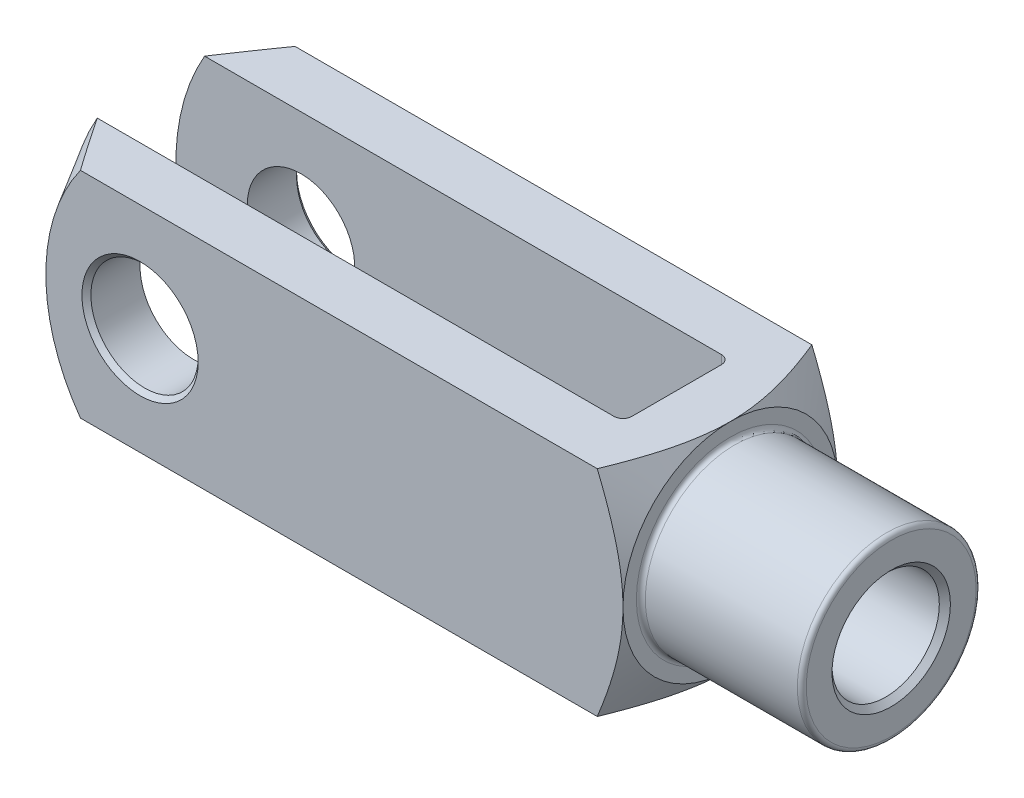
ISO-10303-21;
HEADER;
FILE_DESCRIPTION(('STEP AP214'),'2;1');
FILE_NAME('part.step','',(''),(''),'','','');
FILE_SCHEMA(('AUTOMOTIVE_DESIGN { 1 0 10303 214 1 1 1 1 }'));
ENDSEC;
DATA;
#1=APPLICATION_CONTEXT('core data for automotive mechanical design processes');
#2=APPLICATION_PROTOCOL_DEFINITION('international standard','automotive_design',2000,#1);
#3=PRODUCT_CONTEXT('',#1,'mechanical');
#4=PRODUCT('Part','Part','',(#3));
#5=PRODUCT_RELATED_PRODUCT_CATEGORY('part','',(#4));
#6=PRODUCT_DEFINITION_FORMATION('','',#4);
#7=PRODUCT_DEFINITION_CONTEXT('part definition',#1,'design');
#8=PRODUCT_DEFINITION('design','',#6,#7);
#9=PRODUCT_DEFINITION_SHAPE('','',#8);
#10=(LENGTH_UNIT() NAMED_UNIT(*) SI_UNIT(.MILLI.,.METRE.));
#11=(NAMED_UNIT(*) PLANE_ANGLE_UNIT() SI_UNIT($,.RADIAN.));
#12=(NAMED_UNIT(*) SI_UNIT($,.STERADIAN.) SOLID_ANGLE_UNIT());
#13=UNCERTAINTY_MEASURE_WITH_UNIT(LENGTH_MEASURE(1.E-05),#10,'distance_accuracy_value','');
#14=(GEOMETRIC_REPRESENTATION_CONTEXT(3) GLOBAL_UNCERTAINTY_ASSIGNED_CONTEXT((#13)) GLOBAL_UNIT_ASSIGNED_CONTEXT((#10,
#11,#12)) REPRESENTATION_CONTEXT('',''));
#15=CARTESIAN_POINT('',(0.,0.,0.));
#16=DIRECTION('',(0.,0.,1.));
#17=DIRECTION('',(1.,0.,0.));
#18=AXIS2_PLACEMENT_3D('',#15,#16,#17);
#19=CARTESIAN_POINT('',(-25.,-12.,-4.99999999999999));
#20=DIRECTION('',(0.,-1.,0.));
#21=DIRECTION('',(0.,0.,-1.));
#22=AXIS2_PLACEMENT_3D('',#19,#20,#21);
#23=CYLINDRICAL_SURFACE('',#22,1.);
#24=DIRECTION('',(0.,1.,0.));
#25=VECTOR('',#24,1.);
#26=CARTESIAN_POINT('',(-24.,-12.,-4.99999999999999));
#27=LINE('',#26,#25);
#28=CARTESIAN_POINT('',(-24.,-3.31662479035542,-4.99999999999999));
#29=VERTEX_POINT('',#28);
#30=CARTESIAN_POINT('',(-24.,-12.,-4.99999999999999));
#31=VERTEX_POINT('',#30);
#32=EDGE_CURVE('E357',#29,#31,#27,.F.);
#33=ORIENTED_EDGE('',*,*,#32,.F.);
#34=CARTESIAN_POINT('',(-24.,-3.31662479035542,-4.99999999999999));
#35=CARTESIAN_POINT('',(-24.000039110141,-3.2458892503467,-5.04693073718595));
#36=CARTESIAN_POINT('',(-24.0032998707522,-3.17421071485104,-5.0923055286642));
#37=CARTESIAN_POINT('',(-24.0152871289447,-3.02944292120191,-5.17972843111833));
#38=CARTESIAN_POINT('',(-24.0240049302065,-2.95635608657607,-5.22178171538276));
#39=CARTESIAN_POINT('',(-24.0458771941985,-2.80940810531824,-5.30228419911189));
#40=CARTESIAN_POINT('',(-24.0590080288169,-2.73555307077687,-5.34075122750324));
#41=CARTESIAN_POINT('',(-24.0890023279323,-2.58689159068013,-5.41432119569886));
#42=CARTESIAN_POINT('',(-24.1058679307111,-2.51208462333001,-5.44942219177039));
#43=CARTESIAN_POINT('',(-24.1575747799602,-2.30106419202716,-5.54321172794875));
#44=CARTESIAN_POINT('',(-24.1959404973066,-2.16400188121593,-5.59808248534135));
#45=CARTESIAN_POINT('',(-24.2800168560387,-1.88823561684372,-5.69702137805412));
#46=CARTESIAN_POINT('',(-24.325731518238,-1.74953080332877,-5.74108356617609));
#47=CARTESIAN_POINT('',(-24.422565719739,-1.47057265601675,-5.81880111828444));
#48=CARTESIAN_POINT('',(-24.4737025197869,-1.33031573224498,-5.85242182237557));
#49=CARTESIAN_POINT('',(-24.579554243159,-1.04914006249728,-5.90930382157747));
#50=CARTESIAN_POINT('',(-24.634267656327,-0.908221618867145,-5.9325694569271));
#51=CARTESIAN_POINT('',(-24.7396434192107,-0.64175617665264,-5.96691885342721));
#52=CARTESIAN_POINT('',(-24.7900743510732,-0.516252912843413,-5.97907412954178));
#53=CARTESIAN_POINT('',(-24.891718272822,-0.265271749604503,-5.99544962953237));
#54=CARTESIAN_POINT('',(-24.9429298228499,-0.139794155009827,-5.99968301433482));
#55=CARTESIAN_POINT('',(-24.9960964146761,-0.00956179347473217,-5.99999428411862));
#56=CARTESIAN_POINT('',(-24.9980482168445,-0.00478087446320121,-5.99999999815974));
#57=CARTESIAN_POINT('',(-25.,0.,-6.));
#58=B_SPLINE_CURVE_WITH_KNOTS('',3,(#34,#35,#36,#37,#38,#39,#40,#41,#42,#43,#44,#45,#46,#47,#48,
#49,#50,#51,#52,#53,#54,#55,#56,#57),.UNSPECIFIED.,.F.,.F.,(4,2,2,2,2,2,2,2,2,2,2,4),(0.,
0.254478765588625,0.508553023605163,0.76128804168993,1.01416813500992,1.47107229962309,
1.92822730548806,2.38688397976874,2.8453482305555,3.25253093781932,3.65903657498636,
3.67452851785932),.UNSPECIFIED.);
#59=CARTESIAN_POINT('',(-25.,0.,-6.));
#60=VERTEX_POINT('',#59);
#61=EDGE_CURVE('E390',#29,#60,#58,.T.);
#62=ORIENTED_EDGE('',*,*,#61,.T.);
#63=DIRECTION('',(0.,1.,0.));
#64=VECTOR('',#63,1.);
#65=CARTESIAN_POINT('',(-25.,12.,-5.99999999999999));
#66=LINE('',#65,#64);
#67=CARTESIAN_POINT('',(-25.,-12.,-5.99999999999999));
#68=VERTEX_POINT('',#67);
#69=EDGE_CURVE('E183',#68,#60,#66,.T.);
#70=ORIENTED_EDGE('',*,*,#69,.F.);
#71=CARTESIAN_POINT('',(-25.,-12.,-4.99999999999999));
#72=DIRECTION('',(0.,-1.,0.));
#73=DIRECTION('',(0.,0.,-1.));
#74=AXIS2_PLACEMENT_3D('',#71,#72,#73);
#75=CIRCLE('',#74,1.);
#76=EDGE_CURVE('E197',#31,#68,#75,.F.);
#77=ORIENTED_EDGE('',*,*,#76,.F.);
#78=EDGE_LOOP('',(#33,#62,#70,#77));
#79=FACE_BOUND('',#78,.T.);
#80=ADVANCED_FACE('F37',(#79),#23,.F.);
#81=CARTESIAN_POINT('',(-24.,-12.,-5.99999999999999));
#82=DIRECTION('',(1.,0.,0.));
#83=DIRECTION('',(0.,0.,-1.));
#84=AXIS2_PLACEMENT_3D('',#81,#82,#83);
#85=PLANE('',#84);
#86=CARTESIAN_POINT('',(-24.,12.,-4.99999999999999));
#87=VERTEX_POINT('',#86);
#88=CARTESIAN_POINT('',(-24.,3.31662479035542,-4.99999999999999));
#89=VERTEX_POINT('',#88);
#90=EDGE_CURVE('E373',#87,#89,#27,.F.);
#91=ORIENTED_EDGE('',*,*,#90,.T.);
#92=CARTESIAN_POINT('',(-24.,0.,0.));
#93=DIRECTION('',(1.,0.,0.));
#94=DIRECTION('',(0.,0.,-1.));
#95=AXIS2_PLACEMENT_3D('',#92,#93,#94);
#96=CIRCLE('',#95,6.);
#97=CARTESIAN_POINT('',(-24.,3.31662479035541,5.));
#98=VERTEX_POINT('',#97);
#99=EDGE_CURVE('E780',#89,#98,#96,.T.);
#100=ORIENTED_EDGE('',*,*,#99,.T.);
#101=DIRECTION('',(0.,1.,0.));
#102=VECTOR('',#101,1.);
#103=CARTESIAN_POINT('',(-24.,12.,5.));
#104=LINE('',#103,#102);
#105=CARTESIAN_POINT('',(-24.,12.,5.));
#106=VERTEX_POINT('',#105);
#107=EDGE_CURVE('E160',#98,#106,#104,.T.);
#108=ORIENTED_EDGE('',*,*,#107,.T.);
#109=DIRECTION('',(0.,0.,-1.));
#110=VECTOR('',#109,1.);
#111=CARTESIAN_POINT('',(-24.,12.,-5.99999999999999));
#112=LINE('',#111,#110);
#113=EDGE_CURVE('E338',#106,#87,#112,.T.);
#114=ORIENTED_EDGE('',*,*,#113,.T.);
#115=EDGE_LOOP('',(#91,#100,#108,#114));
#116=FACE_BOUND('',#115,.T.);
#117=ADVANCED_FACE('F497',(#116),#85,.F.);
#118=CARTESIAN_POINT('',(-25.,-12.,5.));
#119=DIRECTION('',(0.,-1.,0.));
#120=DIRECTION('',(0.,0.,-1.));
#121=AXIS2_PLACEMENT_3D('',#118,#119,#120);
#122=CYLINDRICAL_SURFACE('',#121,1.);
#123=ORIENTED_EDGE('',*,*,#107,.F.);
#124=CARTESIAN_POINT('',(-24.,3.31662479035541,5.));
#125=CARTESIAN_POINT('',(-24.000039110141,3.24588925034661,5.04693073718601));
#126=CARTESIAN_POINT('',(-24.0032998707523,3.17421071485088,5.0923055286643));
#127=CARTESIAN_POINT('',(-24.0152871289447,3.02944292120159,5.17972843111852));
#128=CARTESIAN_POINT('',(-24.0240049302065,2.95635608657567,5.22178171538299));
#129=CARTESIAN_POINT('',(-24.0458771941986,2.80940810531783,5.30228419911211));
#130=CARTESIAN_POINT('',(-24.0590080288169,2.73555307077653,5.34075122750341));
#131=CARTESIAN_POINT('',(-24.0890023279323,2.58689159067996,5.41432119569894));
#132=CARTESIAN_POINT('',(-24.1058679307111,2.51208462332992,5.44942219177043));
#133=CARTESIAN_POINT('',(-24.1575747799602,2.30106419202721,5.54321172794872));
#134=CARTESIAN_POINT('',(-24.1959404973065,2.16400188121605,5.59808248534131));
#135=CARTESIAN_POINT('',(-24.2800168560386,1.88823561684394,5.69702137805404));
#136=CARTESIAN_POINT('',(-24.3257315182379,1.74953080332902,5.741083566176));
#137=CARTESIAN_POINT('',(-24.422565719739,1.47057265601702,5.81880111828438));
#138=CARTESIAN_POINT('',(-24.473702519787,1.33031573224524,5.85242182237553));
#139=CARTESIAN_POINT('',(-24.5795542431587,1.04914006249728,5.90930382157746));
#140=CARTESIAN_POINT('',(-24.6342676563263,0.908221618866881,5.93256945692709));
#141=CARTESIAN_POINT('',(-24.7396434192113,0.64175617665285,5.96691885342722));
#142=CARTESIAN_POINT('',(-24.7900743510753,0.516252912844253,5.97907412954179));
#143=CARTESIAN_POINT('',(-24.8917182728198,0.265271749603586,5.99544962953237));
#144=CARTESIAN_POINT('',(-24.9429298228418,0.139794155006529,5.9996830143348));
#145=CARTESIAN_POINT('',(-24.9960964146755,0.00956179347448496,5.99999428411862));
#146=CARTESIAN_POINT('',(-24.9980482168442,0.00478087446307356,5.99999999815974));
#147=CARTESIAN_POINT('',(-25.,0.,6.));
#148=B_SPLINE_CURVE_WITH_KNOTS('',3,(#124,#125,#126,#127,#128,#129,#130,#131,#132,#133,#134,
#135,#136,#137,#138,#139,#140,#141,#142,#143,#144,#145,#146,#147),.UNSPECIFIED.,.F.,.F.,(4,2,2,
2,2,2,2,2,2,2,2,4),(0.,0.25447876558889,0.508553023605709,0.76128804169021,1.01416813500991,
1.47107229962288,1.92822730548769,2.38688397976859,2.84534823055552,3.25253093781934,
3.65903657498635,3.67452851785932),.UNSPECIFIED.);
#149=CARTESIAN_POINT('',(-25.,0.,6.));
#150=VERTEX_POINT('',#149);
#151=EDGE_CURVE('E145',#98,#150,#148,.T.);
#152=ORIENTED_EDGE('',*,*,#151,.T.);
#153=DIRECTION('',(0.,1.,0.));
#154=VECTOR('',#153,1.);
#155=CARTESIAN_POINT('',(-25.,-12.,6.));
#156=LINE('',#155,#154);
#157=CARTESIAN_POINT('',(-25.,12.,6.));
#158=VERTEX_POINT('',#157);
#159=EDGE_CURVE('E159',#158,#150,#156,.F.);
#160=ORIENTED_EDGE('',*,*,#159,.F.);
#161=CARTESIAN_POINT('',(-25.,12.,5.));
#162=DIRECTION('',(0.,1.,0.));
#163=DIRECTION('',(0.,0.,1.));
#164=AXIS2_PLACEMENT_3D('',#161,#162,#163);
#165=CIRCLE('',#164,1.);
#166=EDGE_CURVE('E189',#106,#158,#165,.F.);
#167=ORIENTED_EDGE('',*,*,#166,.F.);
#168=EDGE_LOOP('',(#123,#152,#160,#167));
#169=FACE_BOUND('',#168,.T.);
#170=ADVANCED_FACE('F156',(#169),#122,.F.);
#171=CARTESIAN_POINT('',(-86.,-12.,-5.99999999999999));
#172=DIRECTION('',(0.,0.,-1.));
#173=DIRECTION('',(-1.,0.,0.));
#174=AXIS2_PLACEMENT_3D('',#171,#172,#173);
#175=PLANE('',#174);
#176=CARTESIAN_POINT('',(-72.,0.,-5.99999999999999));
#177=DIRECTION('',(0.,0.,-1.));
#178=DIRECTION('',(-1.,0.,0.));
#179=AXIS2_PLACEMENT_3D('',#176,#177,#178);
#180=CIRCLE('',#179,6.);
#181=CARTESIAN_POINT('',(-78.,0.,-5.99999999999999));
#182=VERTEX_POINT('',#181);
#183=EDGE_CURVE('E367',#182,#182,#180,.F.);
#184=ORIENTED_EDGE('',*,*,#183,.F.);
#185=EDGE_LOOP('',(#184));
#186=FACE_BOUND('',#185,.T.);
#187=CARTESIAN_POINT('',(-62.,0.,-5.99999999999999));
#188=DIRECTION('',(0.,0.,1.));
#189=DIRECTION('',(1.,0.,0.));
#190=AXIS2_PLACEMENT_3D('',#187,#188,#189);
#191=CIRCLE('',#190,24.);
#192=CARTESIAN_POINT('',(-82.7846096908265,12.,-5.99999999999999));
#193=VERTEX_POINT('',#192);
#194=CARTESIAN_POINT('',(-82.7846096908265,-12.,-5.99999999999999));
#195=VERTEX_POINT('',#194);
#196=EDGE_CURVE('E276',#193,#195,#191,.T.);
#197=ORIENTED_EDGE('',*,*,#196,.T.);
#198=DIRECTION('',(-1.,0.,0.));
#199=VECTOR('',#198,1.);
#200=CARTESIAN_POINT('',(-86.,-12.,-5.99999999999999));
#201=LINE('',#200,#199);
#202=EDGE_CURVE('E333',#68,#195,#201,.T.);
#203=ORIENTED_EDGE('',*,*,#202,.F.);
#204=ORIENTED_EDGE('',*,*,#69,.T.);
#205=CARTESIAN_POINT('',(-25.,12.,-5.99999999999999));
#206=VERTEX_POINT('',#205);
#207=EDGE_CURVE('E179',#60,#206,#66,.T.);
#208=ORIENTED_EDGE('',*,*,#207,.T.);
#209=DIRECTION('',(-1.,0.,0.));
#210=VECTOR('',#209,1.);
#211=CARTESIAN_POINT('',(-86.,12.,-5.99999999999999));
#212=LINE('',#211,#210);
#213=EDGE_CURVE('E346',#206,#193,#212,.T.);
#214=ORIENTED_EDGE('',*,*,#213,.T.);
#215=EDGE_LOOP('',(#197,#203,#204,#208,#214));
#216=FACE_BOUND('',#215,.T.);
#217=ADVANCED_FACE('F393',(#186,#216),#175,.F.);
#218=CARTESIAN_POINT('',(-86.,-12.,6.00000000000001));
#219=DIRECTION('',(0.,0.,1.));
#220=DIRECTION('',(1.,0.,0.));
#221=AXIS2_PLACEMENT_3D('',#218,#219,#220);
#222=PLANE('',#221);
#223=CARTESIAN_POINT('',(-72.,0.,6.00000000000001));
#224=DIRECTION('',(0.,0.,1.));
#225=DIRECTION('',(1.,0.,0.));
#226=AXIS2_PLACEMENT_3D('',#223,#224,#225);
#227=CIRCLE('',#226,6.);
#228=CARTESIAN_POINT('',(-66.,0.,6.00000000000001));
#229=VERTEX_POINT('',#228);
#230=EDGE_CURVE('E345',#229,#229,#227,.F.);
#231=ORIENTED_EDGE('',*,*,#230,.F.);
#232=EDGE_LOOP('',(#231));
#233=FACE_BOUND('',#232,.T.);
#234=DIRECTION('',(1.,0.,0.));
#235=VECTOR('',#234,1.);
#236=CARTESIAN_POINT('',(-86.,-12.,6.00000000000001));
#237=LINE('',#236,#235);
#238=CARTESIAN_POINT('',(-82.7846096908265,-12.,6.00000000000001));
#239=VERTEX_POINT('',#238);
#240=CARTESIAN_POINT('',(-25.,-12.,6.));
#241=VERTEX_POINT('',#240);
#242=EDGE_CURVE('E337',#239,#241,#237,.T.);
#243=ORIENTED_EDGE('',*,*,#242,.F.);
#244=CARTESIAN_POINT('',(-62.,0.,6.00000000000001));
#245=DIRECTION('',(0.,0.,1.));
#246=DIRECTION('',(1.,0.,0.));
#247=AXIS2_PLACEMENT_3D('',#244,#245,#246);
#248=CIRCLE('',#247,24.);
#249=CARTESIAN_POINT('',(-82.7846096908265,12.,6.00000000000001));
#250=VERTEX_POINT('',#249);
#251=EDGE_CURVE('E454',#250,#239,#248,.T.);
#252=ORIENTED_EDGE('',*,*,#251,.F.);
#253=DIRECTION('',(1.,0.,0.));
#254=VECTOR('',#253,1.);
#255=CARTESIAN_POINT('',(-86.,12.,6.00000000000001));
#256=LINE('',#255,#254);
#257=EDGE_CURVE('E176',#250,#158,#256,.T.);
#258=ORIENTED_EDGE('',*,*,#257,.T.);
#259=ORIENTED_EDGE('',*,*,#159,.T.);
#260=EDGE_CURVE('E164',#150,#241,#156,.F.);
#261=ORIENTED_EDGE('',*,*,#260,.T.);
#262=EDGE_LOOP('',(#243,#252,#258,#259,#261));
#263=FACE_BOUND('',#262,.T.);
#264=ADVANCED_FACE('F173',(#233,#263),#222,.F.);
#265=CARTESIAN_POINT('',(-86.,-12.,12.));
#266=DIRECTION('',(0.,0.,1.));
#267=DIRECTION('',(1.,0.,0.));
#268=AXIS2_PLACEMENT_3D('',#265,#266,#267);
#269=PLANE('',#268);
#270=CARTESIAN_POINT('',(-72.,0.,12.));
#271=DIRECTION('',(0.,0.,1.));
#272=DIRECTION('',(1.,0.,0.));
#273=AXIS2_PLACEMENT_3D('',#270,#271,#272);
#274=CIRCLE('',#273,6.50000000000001);
#275=CARTESIAN_POINT('',(-65.5,0.,12.));
#276=VERTEX_POINT('',#275);
#277=EDGE_CURVE('E228',#276,#276,#274,.F.);
#278=ORIENTED_EDGE('',*,*,#277,.T.);
#279=EDGE_LOOP('',(#278));
#280=FACE_BOUND('',#279,.T.);
#281=DIRECTION('',(1.,0.,0.));
#282=VECTOR('',#281,1.);
#283=CARTESIAN_POINT('',(-86.,12.,12.));
#284=LINE('',#283,#282);
#285=CARTESIAN_POINT('',(-78.6650269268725,12.,12.));
#286=VERTEX_POINT('',#285);
#287=CARTESIAN_POINT('',(-20.8697557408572,12.,12.));
#288=VERTEX_POINT('',#287);
#289=EDGE_CURVE('E364',#286,#288,#284,.T.);
#290=ORIENTED_EDGE('',*,*,#289,.F.);
#291=CARTESIAN_POINT('',(-62.,0.,12.));
#292=DIRECTION('',(0.,0.,1.));
#293=DIRECTION('',(1.,0.,0.));
#294=AXIS2_PLACEMENT_3D('',#291,#292,#293);
#295=CIRCLE('',#294,20.5358983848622);
#296=CARTESIAN_POINT('',(-78.6650269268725,-12.,12.));
#297=VERTEX_POINT('',#296);
#298=EDGE_CURVE('E61',#286,#297,#295,.T.);
#299=ORIENTED_EDGE('',*,*,#298,.T.);
#300=DIRECTION('',(1.,0.,0.));
#301=VECTOR('',#300,1.);
#302=CARTESIAN_POINT('',(-86.,-12.,12.));
#303=LINE('',#302,#301);
#304=CARTESIAN_POINT('',(-20.8697557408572,-12.,12.));
#305=VERTEX_POINT('',#304);
#306=EDGE_CURVE('E361',#297,#305,#303,.T.);
#307=ORIENTED_EDGE('',*,*,#306,.T.);
#308=CARTESIAN_POINT('',(-26.8270481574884,-24.508852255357,12.));
#309=CARTESIAN_POINT('',(-26.5204158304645,-23.9174203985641,12.));
#310=CARTESIAN_POINT('',(-26.2154046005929,-23.3251403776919,12.));
#311=CARTESIAN_POINT('',(-25.6094839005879,-22.1384473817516,12.));
#312=CARTESIAN_POINT('',(-25.3085746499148,-21.5440342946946,12.));
#313=CARTESIAN_POINT('',(-24.7112306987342,-20.3516642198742,12.));
#314=CARTESIAN_POINT('',(-24.4148047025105,-19.753702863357,12.));
#315=CARTESIAN_POINT('',(-23.8281918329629,-18.5547362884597,12.));
#316=CARTESIAN_POINT('',(-23.5380048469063,-17.9537311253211,12.));
#317=CARTESIAN_POINT('',(-22.9478447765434,-16.7109015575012,12.));
#318=CARTESIAN_POINT('',(-22.6483679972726,-16.0688406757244,12.));
#319=CARTESIAN_POINT('',(-22.0608191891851,-14.7794664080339,12.));
#320=CARTESIAN_POINT('',(-21.7727477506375,-14.132152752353,12.));
#321=CARTESIAN_POINT('',(-21.211729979,-12.8312921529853,12.));
#322=CARTESIAN_POINT('',(-20.9387769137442,-12.177748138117,12.));
#323=CARTESIAN_POINT('',(-20.5444276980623,-11.1914316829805,12.));
#324=CARTESIAN_POINT('',(-20.4154954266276,-10.8616706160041,12.));
#325=CARTESIAN_POINT('',(-20.1634870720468,-10.1999223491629,12.));
#326=CARTESIAN_POINT('',(-20.0404108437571,-9.867935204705,12.));
#327=CARTESIAN_POINT('',(-19.7750973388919,-9.12924658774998,12.));
#328=CARTESIAN_POINT('',(-19.6344928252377,-8.72195527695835,12.));
#329=CARTESIAN_POINT('',(-19.3653837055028,-7.90341175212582,12.));
#330=CARTESIAN_POINT('',(-19.2368780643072,-7.4921598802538,12.));
#331=CARTESIAN_POINT('',(-18.99435151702,-6.66538582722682,12.));
#332=CARTESIAN_POINT('',(-18.8803303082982,-6.24986373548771,12.));
#333=CARTESIAN_POINT('',(-18.6694959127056,-5.41444148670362,12.));
#334=CARTESIAN_POINT('',(-18.5726825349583,-4.99454137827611,12.));
#335=CARTESIAN_POINT('',(-18.4012191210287,-4.16046851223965,12.));
#336=CARTESIAN_POINT('',(-18.3261021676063,-3.74639268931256,12.));
#337=CARTESIAN_POINT('',(-18.1977094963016,-2.91483992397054,12.));
#338=CARTESIAN_POINT('',(-18.1444330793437,-2.49736309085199,12.));
#339=CARTESIAN_POINT('',(-18.061948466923,-1.66028284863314,12.));
#340=CARTESIAN_POINT('',(-18.032724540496,-1.24068101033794,12.));
#341=CARTESIAN_POINT('',(-17.9996341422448,-0.400474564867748,12.));
#342=CARTESIAN_POINT('',(-17.9957667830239,0.0201300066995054,12.));
#343=CARTESIAN_POINT('',(-18.0129154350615,0.830148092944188,12.));
#344=CARTESIAN_POINT('',(-18.0321388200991,1.2196011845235,12.));
#345=CARTESIAN_POINT('',(-18.091746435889,1.99686728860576,12.));
#346=CARTESIAN_POINT('',(-18.1321306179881,2.38468030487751,12.));
#347=CARTESIAN_POINT('',(-18.232579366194,3.15792367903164,12.));
#348=CARTESIAN_POINT('',(-18.2926540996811,3.54335270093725,12.));
#349=CARTESIAN_POINT('',(-18.4305032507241,4.31101186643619,12.));
#350=CARTESIAN_POINT('',(-18.5082781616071,4.69324192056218,12.));
#351=CARTESIAN_POINT('',(-18.6818401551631,5.46519444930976,12.));
#352=CARTESIAN_POINT('',(-18.7780834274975,5.85481356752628,12.));
#353=CARTESIAN_POINT('',(-18.9846981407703,6.63026168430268,12.));
#354=CARTESIAN_POINT('',(-19.0950697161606,7.01609064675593,12.));
#355=CARTESIAN_POINT('',(-19.327805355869,7.78407900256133,12.));
#356=CARTESIAN_POINT('',(-19.450168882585,8.16623855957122,12.));
#357=CARTESIAN_POINT('',(-19.6413066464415,8.73690278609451,12.));
#358=CARTESIAN_POINT('',(-19.706283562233,8.92669203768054,12.));
#359=CARTESIAN_POINT('',(-19.8385670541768,9.30545658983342,12.));
#360=CARTESIAN_POINT('',(-19.9058736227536,9.49443189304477,12.));
#361=CARTESIAN_POINT('',(-20.1221378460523,10.09093133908,12.));
#362=CARTESIAN_POINT('',(-20.2750221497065,10.4970351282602,12.));
#363=CARTESIAN_POINT('',(-20.5890916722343,11.3060297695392,12.));
#364=CARTESIAN_POINT('',(-20.750277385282,11.7089204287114,12.));
#365=CARTESIAN_POINT('',(-21.0796092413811,12.5119467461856,12.));
#366=CARTESIAN_POINT('',(-21.2477569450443,12.9120817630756,12.));
#367=CARTESIAN_POINT('',(-21.5898549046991,13.7098486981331,12.));
#368=CARTESIAN_POINT('',(-21.7638050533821,14.1074806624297,12.));
#369=CARTESIAN_POINT('',(-22.1167497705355,14.900905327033,12.));
#370=CARTESIAN_POINT('',(-22.2957485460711,15.296696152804,12.));
#371=CARTESIAN_POINT('',(-22.6579079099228,16.0863711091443,12.));
#372=CARTESIAN_POINT('',(-22.841068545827,16.4802552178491,12.));
#373=CARTESIAN_POINT('',(-23.3958010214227,17.6593177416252,12.));
#374=CARTESIAN_POINT('',(-23.7726679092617,18.4420054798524,12.));
#375=CARTESIAN_POINT('',(-24.5379796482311,20.004634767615,12.));
#376=CARTESIAN_POINT('',(-24.9264562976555,20.7845606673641,12.));
#377=CARTESIAN_POINT('',(-25.7113669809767,22.3404133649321,12.));
#378=CARTESIAN_POINT('',(-26.107801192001,23.1163400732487,12.));
#379=CARTESIAN_POINT('',(-26.9066094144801,24.6646398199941,12.));
#380=CARTESIAN_POINT('',(-27.3089803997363,25.4370144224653,12.));
#381=CARTESIAN_POINT('',(-28.1185505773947,26.9792185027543,12.));
#382=CARTESIAN_POINT('',(-28.5257497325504,27.7490480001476,12.));
#383=CARTESIAN_POINT('',(-29.6315922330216,29.8271201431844,12.));
#384=CARTESIAN_POINT('',(-30.3338843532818,31.1334202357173,12.));
#385=CARTESIAN_POINT('',(-31.7463886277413,33.7419610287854,12.));
#386=CARTESIAN_POINT('',(-32.4566018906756,35.0442011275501,12.));
#387=CARTESIAN_POINT('',(-33.8786764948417,37.6380871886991,12.));
#388=CARTESIAN_POINT('',(-34.5905050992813,38.9297511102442,12.));
#389=CARTESIAN_POINT('',(-35.6613936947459,40.865371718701,12.));
#390=CARTESIAN_POINT('',(-36.0188525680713,41.5102153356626,12.));
#391=CARTESIAN_POINT('',(-36.7347123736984,42.7993785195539,12.));
#392=CARTESIAN_POINT('',(-37.0931133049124,43.4436980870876,12.));
#393=CARTESIAN_POINT('',(-37.4519232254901,44.0877898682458,12.));
#394=B_SPLINE_CURVE_WITH_KNOTS('',3,(#308,#309,#310,#311,#312,#313,#314,#315,#316,#317,#318,
#319,#320,#321,#322,#323,#324,#325,#326,#327,#328,#329,#330,#331,#332,#333,#334,#335,#336,#337,
#338,#339,#340,#341,#342,#343,#344,#345,#346,#347,#348,#349,#350,#351,#352,#353,#354,#355,#356,
#357,#358,#359,#360,#361,#362,#363,#364,#365,#366,#367,#368,#369,#370,#371,#372,#373,#374,#375,
#376,#377,#378,#379,#380,#381,#382,#383,#384,#385,#386,#387,#388,#389,#390,#391,#392,#393),
.UNSPECIFIED.,.F.,.F.,(4,2,2,2,2,2,2,2,2,2,2,2,2,2,2,2,2,2,2,2,2,2,2,2,2,2,2,2,2,2,2,2,2,2,2,2,
2,2,2,2,2,2,4),(0.,1.99859095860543,3.99728842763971,5.99946635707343,8.00160807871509,
10.1269271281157,12.2523560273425,14.3768307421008,15.4389968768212,16.501136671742,
17.793611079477,19.0859748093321,20.3783115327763,21.6706339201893,22.9326201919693,
24.194566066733,25.4556859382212,26.7167616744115,27.8859474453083,29.0551305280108,
30.2249182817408,31.3947386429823,32.5984184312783,33.8021096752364,35.0057469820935,
35.6075466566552,36.209344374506,37.51100701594,38.8127472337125,40.1147808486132,
41.4167903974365,42.719918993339,44.0230624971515,46.6290236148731,49.2429304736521,
51.8568955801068,54.469571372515,57.082227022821,61.5315331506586,65.9814700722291,
70.4059202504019,72.6177970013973,74.829671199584),.UNSPECIFIED.);
#395=CARTESIAN_POINT('',(-18.,0.,12.));
#396=VERTEX_POINT('',#395);
#397=EDGE_CURVE('E305',#396,#305,#394,.F.);
#398=ORIENTED_EDGE('',*,*,#397,.F.);
#399=EDGE_CURVE('E303',#288,#396,#394,.F.);
#400=ORIENTED_EDGE('',*,*,#399,.F.);
#401=EDGE_LOOP('',(#290,#299,#307,#398,#400));
#402=FACE_BOUND('',#401,.T.);
#403=ADVANCED_FACE('F287',(#280,#402),#269,.T.);
#404=CARTESIAN_POINT('',(-86.,-12.,12.));
#405=DIRECTION('',(0.,-1.,0.));
#406=DIRECTION('',(0.,0.,-1.));
#407=AXIS2_PLACEMENT_3D('',#404,#405,#406);
#408=PLANE('',#407);
#409=ORIENTED_EDGE('',*,*,#202,.T.);
#410=CARTESIAN_POINT('',(-92.2786029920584,-12.,8.84338025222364));
#411=CARTESIAN_POINT('',(-91.6947368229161,-12.,7.90330325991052));
#412=CARTESIAN_POINT('',(-91.1092717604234,-12.,6.96421474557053));
#413=CARTESIAN_POINT('',(-89.9343954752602,-12.,5.08848378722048));
#414=CARTESIAN_POINT('',(-89.3449841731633,-12.,4.15184139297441));
#415=CARTESIAN_POINT('',(-88.1607841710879,-12.,2.28039346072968));
#416=CARTESIAN_POINT('',(-87.565989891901,-12.,1.3455914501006));
#417=CARTESIAN_POINT('',(-86.3707199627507,-12.,-0.520365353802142));
#418=CARTESIAN_POINT('',(-85.7702443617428,-12.,-1.45152017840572));
#419=CARTESIAN_POINT('',(-84.5371594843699,-12.,-3.34796497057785));
#420=CARTESIAN_POINT('',(-83.9042532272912,-12.,-4.31306203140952));
#421=CARTESIAN_POINT('',(-82.6288928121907,-12.,-6.23692872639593));
#422=CARTESIAN_POINT('',(-81.9864387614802,-12.,-7.19569843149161));
#423=CARTESIAN_POINT('',(-81.0137395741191,-12.,-8.62721356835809));
#424=CARTESIAN_POINT('',(-80.6881242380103,-12.,-9.10310585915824));
#425=CARTESIAN_POINT('',(-80.0333476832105,-12.,-10.0524433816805));
#426=CARTESIAN_POINT('',(-79.7041864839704,-12.,-10.5258886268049));
#427=CARTESIAN_POINT('',(-79.0417887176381,-12.,-11.4698924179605));
#428=CARTESIAN_POINT('',(-78.7085523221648,-12.,-11.9404510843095));
#429=CARTESIAN_POINT('',(-78.0373266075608,-12.,-12.8781628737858));
#430=CARTESIAN_POINT('',(-77.6993373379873,-12.,-13.3453160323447));
#431=CARTESIAN_POINT('',(-77.0209560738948,-12.,-14.271205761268));
#432=CARTESIAN_POINT('',(-76.6806158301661,-12.,-14.7299801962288));
#433=CARTESIAN_POINT('',(-75.9934550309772,-12.,-15.6426726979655));
#434=CARTESIAN_POINT('',(-75.6466343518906,-12.,-16.0965906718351));
#435=CARTESIAN_POINT('',(-74.9447774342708,-12.,-16.9990439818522));
#436=CARTESIAN_POINT('',(-74.5897305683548,-12.,-17.4475710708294));
#437=CARTESIAN_POINT('',(-73.8702804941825,-12.,-18.3370436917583));
#438=CARTESIAN_POINT('',(-73.5058777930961,-12.,-18.7779896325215));
#439=CARTESIAN_POINT('',(-72.769436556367,-12.,-19.6456462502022));
#440=CARTESIAN_POINT('',(-72.3975164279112,-12.,-20.0724571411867));
#441=CARTESIAN_POINT('',(-71.6396530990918,-12.,-20.9137472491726));
#442=CARTESIAN_POINT('',(-71.2537063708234,-12.,-21.3282233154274));
#443=CARTESIAN_POINT('',(-70.6621255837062,-12.,-21.936770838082));
#444=CARTESIAN_POINT('',(-70.4630426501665,-12.,-22.137217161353));
#445=CARTESIAN_POINT('',(-70.0599745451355,-12.,-22.5331099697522));
#446=CARTESIAN_POINT('',(-69.8559896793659,-12.,-22.7285567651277));
#447=CARTESIAN_POINT('',(-69.4425971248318,-12.,-23.1134290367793));
#448=CARTESIAN_POINT('',(-69.2331922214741,-12.,-23.3028574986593));
#449=CARTESIAN_POINT('',(-68.8081788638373,-12.,-23.67459803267));
#450=CARTESIAN_POINT('',(-68.5925713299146,-12.,-23.8569111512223));
#451=CARTESIAN_POINT('',(-68.2600203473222,-12.,-24.1270885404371));
#452=CARTESIAN_POINT('',(-68.1456331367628,-12.,-24.2181054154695));
#453=CARTESIAN_POINT('',(-67.9148670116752,-12.,-24.3975755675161));
#454=CARTESIAN_POINT('',(-67.798488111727,-12.,-24.4860288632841));
#455=CARTESIAN_POINT('',(-67.4461413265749,-12.,-24.7471697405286));
#456=CARTESIAN_POINT('',(-67.2069947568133,-12.,-24.9156125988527));
#457=CARTESIAN_POINT('',(-66.7195001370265,-12.,-25.2383188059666));
#458=CARTESIAN_POINT('',(-66.4711595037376,-12.,-25.3925932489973));
#459=CARTESIAN_POINT('',(-65.964514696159,-12.,-25.6835963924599));
#460=CARTESIAN_POINT('',(-65.7062131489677,-12.,-25.8203296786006));
#461=CARTESIAN_POINT('',(-65.0356348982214,-12.,-26.1405466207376));
#462=CARTESIAN_POINT('',(-64.6158504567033,-12.,-26.3091476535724));
#463=CARTESIAN_POINT('',(-63.9703142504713,-12.,-26.5095003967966));
#464=CARTESIAN_POINT('',(-63.7525810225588,-12.,-26.5675140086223));
#465=CARTESIAN_POINT('',(-63.3127569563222,-12.,-26.6640173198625));
#466=CARTESIAN_POINT('',(-63.0906663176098,-12.,-26.702507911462));
#467=CARTESIAN_POINT('',(-62.641579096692,-12.,-26.7585747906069));
#468=CARTESIAN_POINT('',(-62.414555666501,-12.,-26.7759381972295));
#469=CARTESIAN_POINT('',(-61.9599023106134,-12.,-26.7882217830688));
#470=CARTESIAN_POINT('',(-61.7322724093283,-12.,-26.7831428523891));
#471=CARTESIAN_POINT('',(-61.2785688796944,-12.,-26.7507852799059));
#472=CARTESIAN_POINT('',(-61.0524955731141,-12.,-26.7235021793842));
#473=CARTESIAN_POINT('',(-60.6038899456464,-12.,-26.6479928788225));
#474=CARTESIAN_POINT('',(-60.3813581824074,-12.,-26.5997634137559));
#475=CARTESIAN_POINT('',(-59.900551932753,-12.,-26.4736338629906));
#476=CARTESIAN_POINT('',(-59.64328906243,-12.,-26.3918933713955));
#477=CARTESIAN_POINT('',(-59.1371308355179,-12.,-26.2055998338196));
#478=CARTESIAN_POINT('',(-58.8882402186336,-12.,-26.1010341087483));
#479=CARTESIAN_POINT('',(-58.3986617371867,-12.,-25.8726383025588));
#480=CARTESIAN_POINT('',(-58.157999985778,-12.,-25.7487527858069));
#481=CARTESIAN_POINT('',(-57.68547997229,-12.,-25.485398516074));
#482=CARTESIAN_POINT('',(-57.453620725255,-12.,-25.3459315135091));
#483=CARTESIAN_POINT('',(-56.9233788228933,-12.,-25.0064399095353));
#484=CARTESIAN_POINT('',(-56.6281184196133,-12.,-24.8015559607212));
#485=CARTESIAN_POINT('',(-56.0502738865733,-12.,-24.374546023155));
#486=CARTESIAN_POINT('',(-55.7676958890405,-12.,-24.1524118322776));
#487=CARTESIAN_POINT('',(-55.2130794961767,-12.,-23.6943719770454));
#488=CARTESIAN_POINT('',(-54.941062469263,-12.,-23.4584405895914));
#489=CARTESIAN_POINT('',(-54.406626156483,-12.,-22.9760898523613));
#490=CARTESIAN_POINT('',(-54.1442052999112,-12.,-22.7296722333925));
#491=CARTESIAN_POINT('',(-53.6258300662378,-12.,-22.2267453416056));
#492=CARTESIAN_POINT('',(-53.3699307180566,-12.,-21.9701795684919));
#493=CARTESIAN_POINT('',(-52.8652654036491,-12.,-21.4501311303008));
#494=CARTESIAN_POINT('',(-52.6164996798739,-12.,-21.1866482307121));
#495=CARTESIAN_POINT('',(-52.1253910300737,-12.,-20.6542828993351));
#496=CARTESIAN_POINT('',(-51.8830417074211,-12.,-20.3854063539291));
#497=CARTESIAN_POINT('',(-51.4036952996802,-12.,-19.8429441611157));
#498=CARTESIAN_POINT('',(-51.1666981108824,-12.,-19.5693586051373));
#499=CARTESIAN_POINT('',(-50.6001496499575,-12.,-18.9040671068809));
#500=CARTESIAN_POINT('',(-50.2729278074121,-12.,-18.5103784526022));
#501=CARTESIAN_POINT('',(-49.626186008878,-12.,-17.7166170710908));
#502=CARTESIAN_POINT('',(-49.3066675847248,-12.,-17.316543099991));
#503=CARTESIAN_POINT('',(-48.6790054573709,-12.,-16.5174455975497));
#504=CARTESIAN_POINT('',(-48.3707624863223,-12.,-16.1184998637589));
#505=CARTESIAN_POINT('',(-47.7597996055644,-12.,-15.316589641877));
#506=CARTESIAN_POINT('',(-47.4570780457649,-12.,-14.9136264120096));
#507=CARTESIAN_POINT('',(-47.1566197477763,-12.,-14.5090044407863));
#508=B_SPLINE_CURVE_WITH_KNOTS('',3,(#410,#411,#412,#413,#414,#415,#416,#417,#418,#419,#420,
#421,#422,#423,#424,#425,#426,#427,#428,#429,#430,#431,#432,#433,#434,#435,#436,#437,#438,#439,
#440,#441,#442,#443,#444,#445,#446,#447,#448,#449,#450,#451,#452,#453,#454,#455,#456,#457,#458,
#459,#460,#461,#462,#463,#464,#465,#466,#467,#468,#469,#470,#471,#472,#473,#474,#475,#476,#477,
#478,#479,#480,#481,#482,#483,#484,#485,#486,#487,#488,#489,#490,#491,#492,#493,#494,#495,#496,
#497,#498,#499,#500,#501,#502,#503,#504,#505,#506,#507),.UNSPECIFIED.,.F.,.F.,(4,2,2,2,2,2,2,2,
2,2,2,2,2,2,2,2,2,2,2,2,2,2,2,2,2,2,2,2,2,2,2,2,2,2,2,2,2,2,2,2,2,2,2,2,2,2,2,2,4),(0.,
3.31991386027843,6.63989474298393,9.96383874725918,13.2877541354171,16.7500600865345,
20.2123271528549,21.942195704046,23.6720547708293,25.4018412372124,27.1316096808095,
28.8452569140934,30.5589368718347,32.2749700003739,33.9909103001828,35.6890521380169,
37.3876240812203,38.2350900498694,39.0825033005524,39.9294893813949,40.7763504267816,
41.2148575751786,41.6533615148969,42.5304910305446,43.4069277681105,44.2831349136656,
45.6347123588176,46.3099700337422,46.9851968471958,47.667172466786,48.3491210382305,
49.031206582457,49.7133984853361,50.5219110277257,51.3308738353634,52.1422020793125,
52.9534392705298,54.0307393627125,55.1085548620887,56.1884481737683,57.2681639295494,
58.3551054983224,59.4420839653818,60.5279345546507,61.6137640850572,63.1494038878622,
64.68534657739,66.1977597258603,67.7097132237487),.UNSPECIFIED.);
#509=CARTESIAN_POINT('',(-78.6650269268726,-12.,-12.));
#510=VERTEX_POINT('',#509);
#511=EDGE_CURVE('E275',#195,#510,#508,.T.);
#512=ORIENTED_EDGE('',*,*,#511,.T.);
#513=DIRECTION('',(1.,0.,0.));
#514=VECTOR('',#513,1.);
#515=CARTESIAN_POINT('',(-86.,-12.,-12.));
#516=LINE('',#515,#514);
#517=CARTESIAN_POINT('',(-20.8697557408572,-12.,-12.));
#518=VERTEX_POINT('',#517);
#519=EDGE_CURVE('E358',#510,#518,#516,.T.);
#520=ORIENTED_EDGE('',*,*,#519,.T.);
#521=CARTESIAN_POINT('',(-26.8270481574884,-12.,-24.508852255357));
#522=CARTESIAN_POINT('',(-26.5204158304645,-12.,-23.9174203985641));
#523=CARTESIAN_POINT('',(-26.2154046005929,-12.,-23.3251403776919));
#524=CARTESIAN_POINT('',(-25.6094839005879,-12.,-22.1384473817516));
#525=CARTESIAN_POINT('',(-25.3085746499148,-12.,-21.5440342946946));
#526=CARTESIAN_POINT('',(-24.7112306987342,-12.,-20.3516642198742));
#527=CARTESIAN_POINT('',(-24.4148047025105,-12.,-19.753702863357));
#528=CARTESIAN_POINT('',(-23.8281918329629,-12.,-18.5547362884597));
#529=CARTESIAN_POINT('',(-23.5380048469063,-12.,-17.9537311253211));
#530=CARTESIAN_POINT('',(-22.9478447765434,-12.,-16.7109015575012));
#531=CARTESIAN_POINT('',(-22.6483679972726,-12.,-16.0688406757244));
#532=CARTESIAN_POINT('',(-22.0608191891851,-12.,-14.7794664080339));
#533=CARTESIAN_POINT('',(-21.7727477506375,-12.,-14.132152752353));
#534=CARTESIAN_POINT('',(-21.211729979,-12.,-12.8312921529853));
#535=CARTESIAN_POINT('',(-20.9387769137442,-12.,-12.177748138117));
#536=CARTESIAN_POINT('',(-20.5444276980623,-12.,-11.1914316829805));
#537=CARTESIAN_POINT('',(-20.4154954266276,-12.,-10.8616706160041));
#538=CARTESIAN_POINT('',(-20.1634870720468,-12.,-10.1999223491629));
#539=CARTESIAN_POINT('',(-20.0404108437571,-12.,-9.867935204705));
#540=CARTESIAN_POINT('',(-19.7750973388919,-12.,-9.12924658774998));
#541=CARTESIAN_POINT('',(-19.6344928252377,-12.,-8.72195527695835));
#542=CARTESIAN_POINT('',(-19.3653837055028,-12.,-7.90341175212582));
#543=CARTESIAN_POINT('',(-19.2368780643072,-12.,-7.4921598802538));
#544=CARTESIAN_POINT('',(-18.99435151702,-12.,-6.66538582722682));
#545=CARTESIAN_POINT('',(-18.8803303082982,-12.,-6.24986373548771));
#546=CARTESIAN_POINT('',(-18.6694959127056,-12.,-5.41444148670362));
#547=CARTESIAN_POINT('',(-18.5726825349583,-12.,-4.99454137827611));
#548=CARTESIAN_POINT('',(-18.4012191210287,-12.,-4.16046851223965));
#549=CARTESIAN_POINT('',(-18.3261021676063,-12.,-3.74639268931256));
#550=CARTESIAN_POINT('',(-18.1977094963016,-12.,-2.91483992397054));
#551=CARTESIAN_POINT('',(-18.1444330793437,-12.,-2.49736309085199));
#552=CARTESIAN_POINT('',(-18.061948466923,-12.,-1.66028284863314));
#553=CARTESIAN_POINT('',(-18.032724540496,-12.,-1.24068101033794));
#554=CARTESIAN_POINT('',(-17.9996341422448,-12.,-0.400474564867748));
#555=CARTESIAN_POINT('',(-17.9957667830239,-12.,0.0201300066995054));
#556=CARTESIAN_POINT('',(-18.0129154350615,-12.,0.830148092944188));
#557=CARTESIAN_POINT('',(-18.0321388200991,-12.,1.2196011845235));
#558=CARTESIAN_POINT('',(-18.091746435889,-12.,1.99686728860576));
#559=CARTESIAN_POINT('',(-18.1321306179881,-12.,2.38468030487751));
#560=CARTESIAN_POINT('',(-18.232579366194,-12.,3.15792367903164));
#561=CARTESIAN_POINT('',(-18.2926540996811,-12.,3.54335270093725));
#562=CARTESIAN_POINT('',(-18.4305032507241,-12.,4.31101186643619));
#563=CARTESIAN_POINT('',(-18.5082781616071,-12.,4.69324192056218));
#564=CARTESIAN_POINT('',(-18.6818401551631,-12.,5.46519444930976));
#565=CARTESIAN_POINT('',(-18.7780834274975,-12.,5.85481356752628));
#566=CARTESIAN_POINT('',(-18.9846981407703,-12.,6.63026168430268));
#567=CARTESIAN_POINT('',(-19.0950697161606,-12.,7.01609064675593));
#568=CARTESIAN_POINT('',(-19.327805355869,-12.,7.78407900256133));
#569=CARTESIAN_POINT('',(-19.450168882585,-12.,8.16623855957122));
#570=CARTESIAN_POINT('',(-19.6413066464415,-12.,8.73690278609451));
#571=CARTESIAN_POINT('',(-19.706283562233,-12.,8.92669203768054));
#572=CARTESIAN_POINT('',(-19.8385670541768,-12.,9.30545658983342));
#573=CARTESIAN_POINT('',(-19.9058736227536,-12.,9.49443189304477));
#574=CARTESIAN_POINT('',(-20.1221378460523,-12.,10.09093133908));
#575=CARTESIAN_POINT('',(-20.2750221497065,-12.,10.4970351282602));
#576=CARTESIAN_POINT('',(-20.5890916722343,-12.,11.3060297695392));
#577=CARTESIAN_POINT('',(-20.750277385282,-12.,11.7089204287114));
#578=CARTESIAN_POINT('',(-21.0796092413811,-12.,12.5119467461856));
#579=CARTESIAN_POINT('',(-21.2477569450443,-12.,12.9120817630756));
#580=CARTESIAN_POINT('',(-21.5898549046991,-12.,13.7098486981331));
#581=CARTESIAN_POINT('',(-21.7638050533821,-12.,14.1074806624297));
#582=CARTESIAN_POINT('',(-22.1167497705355,-12.,14.900905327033));
#583=CARTESIAN_POINT('',(-22.2957485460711,-12.,15.296696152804));
#584=CARTESIAN_POINT('',(-22.6579079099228,-12.,16.0863711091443));
#585=CARTESIAN_POINT('',(-22.841068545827,-12.,16.4802552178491));
#586=CARTESIAN_POINT('',(-23.3958010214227,-12.,17.6593177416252));
#587=CARTESIAN_POINT('',(-23.7726679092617,-12.,18.4420054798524));
#588=CARTESIAN_POINT('',(-24.5379796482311,-12.,20.004634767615));
#589=CARTESIAN_POINT('',(-24.9264562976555,-12.,20.7845606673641));
#590=CARTESIAN_POINT('',(-25.7113669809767,-12.,22.3404133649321));
#591=CARTESIAN_POINT('',(-26.107801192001,-12.,23.1163400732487));
#592=CARTESIAN_POINT('',(-26.9066094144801,-12.,24.6646398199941));
#593=CARTESIAN_POINT('',(-27.3089803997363,-12.,25.4370144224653));
#594=CARTESIAN_POINT('',(-28.1185505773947,-12.,26.9792185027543));
#595=CARTESIAN_POINT('',(-28.5257497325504,-12.,27.7490480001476));
#596=CARTESIAN_POINT('',(-29.6315922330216,-12.,29.8271201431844));
#597=CARTESIAN_POINT('',(-30.3338843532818,-12.,31.1334202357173));
#598=CARTESIAN_POINT('',(-31.7463886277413,-12.,33.7419610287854));
#599=CARTESIAN_POINT('',(-32.4566018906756,-12.,35.0442011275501));
#600=CARTESIAN_POINT('',(-33.8786764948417,-12.,37.6380871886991));
#601=CARTESIAN_POINT('',(-34.5905050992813,-12.,38.9297511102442));
#602=CARTESIAN_POINT('',(-35.6613936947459,-12.,40.865371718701));
#603=CARTESIAN_POINT('',(-36.0188525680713,-12.,41.5102153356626));
#604=CARTESIAN_POINT('',(-36.7347123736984,-12.,42.7993785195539));
#605=CARTESIAN_POINT('',(-37.0931133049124,-12.,43.4436980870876));
#606=CARTESIAN_POINT('',(-37.4519232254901,-12.,44.0877898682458));
#607=B_SPLINE_CURVE_WITH_KNOTS('',3,(#521,#522,#523,#524,#525,#526,#527,#528,#529,#530,#531,
#532,#533,#534,#535,#536,#537,#538,#539,#540,#541,#542,#543,#544,#545,#546,#547,#548,#549,#550,
#551,#552,#553,#554,#555,#556,#557,#558,#559,#560,#561,#562,#563,#564,#565,#566,#567,#568,#569,
#570,#571,#572,#573,#574,#575,#576,#577,#578,#579,#580,#581,#582,#583,#584,#585,#586,#587,#588,
#589,#590,#591,#592,#593,#594,#595,#596,#597,#598,#599,#600,#601,#602,#603,#604,#605,#606),
.UNSPECIFIED.,.F.,.F.,(4,2,2,2,2,2,2,2,2,2,2,2,2,2,2,2,2,2,2,2,2,2,2,2,2,2,2,2,2,2,2,2,2,2,2,2,
2,2,2,2,2,2,4),(0.,1.99859095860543,3.99728842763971,5.99946635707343,8.00160807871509,
10.1269271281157,12.2523560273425,14.3768307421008,15.4389968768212,16.501136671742,
17.793611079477,19.0859748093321,20.3783115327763,21.6706339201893,22.9326201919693,
24.194566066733,25.4556859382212,26.7167616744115,27.8859474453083,29.0551305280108,
30.2249182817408,31.3947386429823,32.5984184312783,33.8021096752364,35.0057469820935,
35.6075466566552,36.209344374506,37.51100701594,38.8127472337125,40.1147808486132,
41.4167903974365,42.719918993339,44.0230624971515,46.6290236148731,49.2429304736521,
51.8568955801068,54.469571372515,57.082227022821,61.5315331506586,65.9814700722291,
70.4059202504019,72.6177970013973,74.829671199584),.UNSPECIFIED.);
#608=CARTESIAN_POINT('',(-18.,-12.,0.));
#609=VERTEX_POINT('',#608);
#610=EDGE_CURVE('E304',#609,#518,#607,.F.);
#611=ORIENTED_EDGE('',*,*,#610,.F.);
#612=EDGE_CURVE('E295',#305,#609,#607,.F.);
#613=ORIENTED_EDGE('',*,*,#612,.F.);
#614=ORIENTED_EDGE('',*,*,#306,.F.);
#615=CARTESIAN_POINT('',(-47.1566197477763,-12.,14.5090044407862));
#616=CARTESIAN_POINT('',(-47.4006935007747,-12.,14.8377253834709));
#617=CARTESIAN_POINT('',(-47.646275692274,-12.,15.1653349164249));
#618=CARTESIAN_POINT('',(-48.1409326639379,-12.,15.8179416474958));
#619=CARTESIAN_POINT('',(-48.3900076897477,-12.,16.142938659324));
#620=CARTESIAN_POINT('',(-48.8925369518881,-12.,16.7904580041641));
#621=CARTESIAN_POINT('',(-49.1459981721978,-12.,17.1129749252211));
#622=CARTESIAN_POINT('',(-49.6574352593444,-12.,17.7544019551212));
#623=CARTESIAN_POINT('',(-49.9154110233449,-12.,18.0733121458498));
#624=CARTESIAN_POINT('',(-50.439130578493,-12.,18.7099803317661));
#625=CARTESIAN_POINT('',(-50.70492584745,-12.,19.0276960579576));
#626=CARTESIAN_POINT('',(-51.2426663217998,-12.,19.6578767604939));
#627=CARTESIAN_POINT('',(-51.5146113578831,-12.,19.9703418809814));
#628=CARTESIAN_POINT('',(-52.0655161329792,-12.,20.5886723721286));
#629=CARTESIAN_POINT('',(-52.3444711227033,-12.,20.8945419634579));
#630=CARTESIAN_POINT('',(-52.9108142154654,-12.,21.4983473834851));
#631=CARTESIAN_POINT('',(-53.1982014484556,-12.,21.7962840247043));
#632=CARTESIAN_POINT('',(-53.7368573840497,-12.,22.3359554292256));
#633=CARTESIAN_POINT('',(-53.9866698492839,-12.,22.5791402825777));
#634=CARTESIAN_POINT('',(-54.4945610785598,-12.,23.0568078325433));
#635=CARTESIAN_POINT('',(-54.7526406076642,-12.,23.2912897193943));
#636=CARTESIAN_POINT('',(-55.2785039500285,-12.,23.7494696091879));
#637=CARTESIAN_POINT('',(-55.5462931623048,-12.,23.9731614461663));
#638=CARTESIAN_POINT('',(-56.0929157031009,-12.,24.4066687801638));
#639=CARTESIAN_POINT('',(-56.371747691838,-12.,24.6164859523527));
#640=CARTESIAN_POINT('',(-56.9019016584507,-12.,24.9899890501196));
#641=CARTESIAN_POINT('',(-57.1515693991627,-12.,25.1560107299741));
#642=CARTESIAN_POINT('',(-57.6612415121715,-12.,25.4716054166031));
#643=CARTESIAN_POINT('',(-57.9212474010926,-12.,25.6211759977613));
#644=CARTESIAN_POINT('',(-58.4513266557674,-12.,25.8992289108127));
#645=CARTESIAN_POINT('',(-58.7213645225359,-12.,26.0277782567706));
#646=CARTESIAN_POINT('',(-59.2721724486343,-12.,26.2593735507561));
#647=CARTESIAN_POINT('',(-59.5529357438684,-12.,26.36243527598));
#648=CARTESIAN_POINT('',(-60.0339246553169,-12.,26.5101311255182));
#649=CARTESIAN_POINT('',(-60.2316480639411,-12.,26.5629427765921));
#650=CARTESIAN_POINT('',(-60.63071076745,-12.,26.6525383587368));
#651=CARTESIAN_POINT('',(-60.832049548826,-12.,26.6893245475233));
#652=CARTESIAN_POINT('',(-61.23702442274,-12.,26.7455720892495));
#653=CARTESIAN_POINT('',(-61.4406589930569,-12.,26.7650443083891));
#654=CARTESIAN_POINT('',(-61.8488647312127,-12.,26.785964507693));
#655=CARTESIAN_POINT('',(-62.053435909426,-12.,26.7874122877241));
#656=CARTESIAN_POINT('',(-62.461994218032,-12.,26.7722217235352));
#657=CARTESIAN_POINT('',(-62.6659810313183,-12.,26.7555749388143));
#658=CARTESIAN_POINT('',(-63.0717491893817,-12.,26.7048226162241));
#659=CARTESIAN_POINT('',(-63.2735305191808,-12.,26.6707169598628));
#660=CARTESIAN_POINT('',(-63.6737302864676,-12.,26.586233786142));
#661=CARTESIAN_POINT('',(-63.872147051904,-12.,26.5358484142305));
#662=CARTESIAN_POINT('',(-64.2646355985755,-12.,26.4203795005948));
#663=CARTESIAN_POINT('',(-64.4587067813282,-12.,26.3552939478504));
#664=CARTESIAN_POINT('',(-64.9503508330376,-12.,26.1716421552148));
#665=CARTESIAN_POINT('',(-65.244411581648,-12.,26.0436428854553));
#666=CARTESIAN_POINT('',(-65.8200460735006,-12.,25.7621328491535));
#667=CARTESIAN_POINT('',(-66.1016111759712,-12.,25.6086047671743));
#668=CARTESIAN_POINT('',(-66.6538882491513,-12.,25.2808079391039));
#669=CARTESIAN_POINT('',(-66.9245503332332,-12.,25.1064557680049));
#670=CARTESIAN_POINT('',(-67.322192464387,-12.,24.8330606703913));
#671=CARTESIAN_POINT('',(-67.4533297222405,-12.,24.7399654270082));
#672=CARTESIAN_POINT('',(-67.7130123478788,-12.,24.5502281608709));
#673=CARTESIAN_POINT('',(-67.8415577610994,-12.,24.4535862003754));
#674=CARTESIAN_POINT('',(-68.2265403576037,-12.,24.1566253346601));
#675=CARTESIAN_POINT('',(-68.4792216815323,-12.,23.9514271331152));
#676=CARTESIAN_POINT('',(-68.9758993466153,-12.,23.5307334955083));
#677=CARTESIAN_POINT('',(-69.2198935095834,-12.,23.3152355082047));
#678=CARTESIAN_POINT('',(-69.7004970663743,-12.,22.875739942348));
#679=CARTESIAN_POINT('',(-69.9370993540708,-12.,22.6517346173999));
#680=CARTESIAN_POINT('',(-70.4036408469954,-12.,22.1969500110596));
#681=CARTESIAN_POINT('',(-70.6335805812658,-12.,21.9661712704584));
#682=CARTESIAN_POINT('',(-71.0884661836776,-12.,21.4981654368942));
#683=CARTESIAN_POINT('',(-71.3133914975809,-12.,21.2609184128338));
#684=CARTESIAN_POINT('',(-71.7581310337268,-12.,20.7816738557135));
#685=CARTESIAN_POINT('',(-71.9779450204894,-12.,20.5396761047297));
#686=CARTESIAN_POINT('',(-72.6304428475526,-12.,19.8079461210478));
#687=CARTESIAN_POINT('',(-73.0564201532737,-12.,19.3122296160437));
#688=CARTESIAN_POINT('',(-73.8995350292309,-12.,18.302930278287));
#689=CARTESIAN_POINT('',(-74.316497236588,-12.,17.7892020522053));
#690=CARTESIAN_POINT('',(-75.1390100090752,-12.,16.7526316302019));
#691=CARTESIAN_POINT('',(-75.5445594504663,-12.,16.2297885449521));
#692=CARTESIAN_POINT('',(-76.3455156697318,-12.,15.1782111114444));
#693=CARTESIAN_POINT('',(-76.7409426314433,-12.,14.6494920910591));
#694=CARTESIAN_POINT('',(-77.5242277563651,-12.,13.5864682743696));
#695=CARTESIAN_POINT('',(-77.9120857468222,-12.,13.0521633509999));
#696=CARTESIAN_POINT('',(-78.6131185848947,-12.,12.0744067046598));
#697=CARTESIAN_POINT('',(-78.9273148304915,-12.,11.6316858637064));
#698=CARTESIAN_POINT('',(-79.5520062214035,-12.,10.7436390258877));
#699=CARTESIAN_POINT('',(-79.8625013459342,-12.,10.2983130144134));
#700=CARTESIAN_POINT('',(-80.789178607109,-12.,8.95897562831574));
#701=CARTESIAN_POINT('',(-81.4005374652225,-12.,8.06162616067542));
#702=CARTESIAN_POINT('',(-82.6138369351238,-12.,6.25942290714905));
#703=CARTESIAN_POINT('',(-83.215768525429,-12.,5.35456306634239));
#704=CARTESIAN_POINT('',(-84.4117122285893,-12.,3.53962237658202));
#705=CARTESIAN_POINT('',(-85.0057242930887,-12.,2.62954149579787));
#706=CARTESIAN_POINT('',(-86.1630557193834,-12.,0.84275825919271));
#707=CARTESIAN_POINT('',(-86.7266326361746,-12.,-0.0337774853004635));
#708=CARTESIAN_POINT('',(-87.8489312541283,-12.,-1.78995672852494));
#709=CARTESIAN_POINT('',(-88.4076529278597,-12.,-2.66960024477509));
#710=CARTESIAN_POINT('',(-89.5203708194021,-12.,-4.43038447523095));
#711=CARTESIAN_POINT('',(-90.0743719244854,-12.,-5.31152210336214));
#712=CARTESIAN_POINT('',(-91.1789232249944,-12.,-7.07594027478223));
#713=CARTESIAN_POINT('',(-91.7294734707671,-12.,-7.95922078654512));
#714=CARTESIAN_POINT('',(-92.2786029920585,-12.,-8.84338025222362));
#715=B_SPLINE_CURVE_WITH_KNOTS('',3,(#615,#616,#617,#618,#619,#620,#621,#622,#623,#624,#625,
#626,#627,#628,#629,#630,#631,#632,#633,#634,#635,#636,#637,#638,#639,#640,#641,#642,#643,#644,
#645,#646,#647,#648,#649,#650,#651,#652,#653,#654,#655,#656,#657,#658,#659,#660,#661,#662,#663,
#664,#665,#666,#667,#668,#669,#670,#671,#672,#673,#674,#675,#676,#677,#678,#679,#680,#681,#682,
#683,#684,#685,#686,#687,#688,#689,#690,#691,#692,#693,#694,#695,#696,#697,#698,#699,#700,#701,
#702,#703,#704,#705,#706,#707,#708,#709,#710,#711,#712,#713,#714),.UNSPECIFIED.,.F.,.F.,(4,2,2,
2,2,2,2,2,2,2,2,2,2,2,2,2,2,2,2,2,2,2,2,2,2,2,2,2,2,2,2,2,2,2,2,2,2,2,2,2,2,2,2,2,2,2,2,2,2,4),
(0.,1.22828326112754,2.45665334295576,3.68720224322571,4.91772314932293,6.1603611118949,
7.40296490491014,8.6447483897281,9.88640419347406,10.9321367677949,11.9779663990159,
13.0243867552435,14.0706805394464,14.9696581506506,15.8687681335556,16.7649534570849,
17.6605826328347,18.2739693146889,18.8872695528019,19.5001846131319,20.1131064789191,
20.726314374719,21.3395264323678,21.9530347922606,22.5666271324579,23.5271014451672,
24.4882298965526,25.4533468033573,25.9357663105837,26.4181773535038,27.3943184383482,
28.3707025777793,29.3479981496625,30.325215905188,31.3058921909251,32.2866135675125,
34.247027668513,36.2317763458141,38.2167197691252,40.1973359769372,42.17799733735,
43.8066233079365,45.4352584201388,48.6926069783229,51.9529025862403,55.2132180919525,
58.3394441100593,61.4656877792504,64.5881602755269,67.7105871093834),.UNSPECIFIED.);
#716=EDGE_CURVE('E266',#297,#239,#715,.T.);
#717=ORIENTED_EDGE('',*,*,#716,.T.);
#718=ORIENTED_EDGE('',*,*,#242,.T.);
#719=CARTESIAN_POINT('',(-25.,-12.,5.));
#720=DIRECTION('',(0.,-1.,0.));
#721=DIRECTION('',(0.,0.,-1.));
#722=AXIS2_PLACEMENT_3D('',#719,#720,#721);
#723=CIRCLE('',#722,1.);
#724=CARTESIAN_POINT('',(-24.,-12.,5.));
#725=VERTEX_POINT('',#724);
#726=EDGE_CURVE('E166',#241,#725,#723,.F.);
#727=ORIENTED_EDGE('',*,*,#726,.T.);
#728=DIRECTION('',(0.,0.,-1.));
#729=VECTOR('',#728,1.);
#730=CARTESIAN_POINT('',(-24.,-12.,-5.99999999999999));
#731=LINE('',#730,#729);
#732=EDGE_CURVE('E341',#725,#31,#731,.T.);
#733=ORIENTED_EDGE('',*,*,#732,.T.);
#734=ORIENTED_EDGE('',*,*,#76,.T.);
#735=EDGE_LOOP('',(#409,#512,#520,#611,#613,#614,#717,#718,#727,#733,#734));
#736=FACE_BOUND('',#735,.T.);
#737=ADVANCED_FACE('F282',(#736),#408,.T.);
#738=CARTESIAN_POINT('',(-86.,-12.,-12.));
#739=DIRECTION('',(0.,0.,-1.));
#740=DIRECTION('',(-1.,0.,0.));
#741=AXIS2_PLACEMENT_3D('',#738,#739,#740);
#742=PLANE('',#741);
#743=CARTESIAN_POINT('',(-72.,0.,-12.));
#744=DIRECTION('',(0.,0.,-1.));
#745=DIRECTION('',(-1.,0.,0.));
#746=AXIS2_PLACEMENT_3D('',#743,#744,#745);
#747=CIRCLE('',#746,6.49999999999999);
#748=CARTESIAN_POINT('',(-78.5,0.,-12.));
#749=VERTEX_POINT('',#748);
#750=EDGE_CURVE('E216',#749,#749,#747,.F.);
#751=ORIENTED_EDGE('',*,*,#750,.T.);
#752=EDGE_LOOP('',(#751));
#753=FACE_BOUND('',#752,.T.);
#754=ORIENTED_EDGE('',*,*,#519,.F.);
#755=CARTESIAN_POINT('',(-62.,0.,-12.));
#756=DIRECTION('',(0.,0.,1.));
#757=DIRECTION('',(1.,0.,0.));
#758=AXIS2_PLACEMENT_3D('',#755,#756,#757);
#759=CIRCLE('',#758,20.5358983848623);
#760=CARTESIAN_POINT('',(-78.6650269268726,12.,-12.));
#761=VERTEX_POINT('',#760);
#762=EDGE_CURVE('E406',#761,#510,#759,.T.);
#763=ORIENTED_EDGE('',*,*,#762,.F.);
#764=DIRECTION('',(1.,0.,0.));
#765=VECTOR('',#764,1.);
#766=CARTESIAN_POINT('',(-86.,12.,-12.));
#767=LINE('',#766,#765);
#768=CARTESIAN_POINT('',(-20.8697557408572,12.,-12.));
#769=VERTEX_POINT('',#768);
#770=EDGE_CURVE('E355',#761,#769,#767,.T.);
#771=ORIENTED_EDGE('',*,*,#770,.T.);
#772=CARTESIAN_POINT('',(-26.8270481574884,-24.508852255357,-12.));
#773=CARTESIAN_POINT('',(-26.5204158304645,-23.9174203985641,-12.));
#774=CARTESIAN_POINT('',(-26.2154046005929,-23.3251403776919,-12.));
#775=CARTESIAN_POINT('',(-25.6094839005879,-22.1384473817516,-12.));
#776=CARTESIAN_POINT('',(-25.3085746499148,-21.5440342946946,-12.));
#777=CARTESIAN_POINT('',(-24.7112306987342,-20.3516642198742,-12.));
#778=CARTESIAN_POINT('',(-24.4148047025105,-19.753702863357,-12.));
#779=CARTESIAN_POINT('',(-23.8281918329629,-18.5547362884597,-12.));
#780=CARTESIAN_POINT('',(-23.5380048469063,-17.9537311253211,-12.));
#781=CARTESIAN_POINT('',(-22.9478447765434,-16.7109015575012,-12.));
#782=CARTESIAN_POINT('',(-22.6483679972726,-16.0688406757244,-12.));
#783=CARTESIAN_POINT('',(-22.0608191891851,-14.7794664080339,-12.));
#784=CARTESIAN_POINT('',(-21.7727477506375,-14.132152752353,-12.));
#785=CARTESIAN_POINT('',(-21.211729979,-12.8312921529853,-12.));
#786=CARTESIAN_POINT('',(-20.9387769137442,-12.177748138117,-12.));
#787=CARTESIAN_POINT('',(-20.5444276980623,-11.1914316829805,-12.));
#788=CARTESIAN_POINT('',(-20.4154954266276,-10.8616706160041,-12.));
#789=CARTESIAN_POINT('',(-20.1634870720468,-10.1999223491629,-12.));
#790=CARTESIAN_POINT('',(-20.0404108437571,-9.867935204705,-12.));
#791=CARTESIAN_POINT('',(-19.7750973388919,-9.12924658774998,-12.));
#792=CARTESIAN_POINT('',(-19.6344928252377,-8.72195527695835,-12.));
#793=CARTESIAN_POINT('',(-19.3653837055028,-7.90341175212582,-12.));
#794=CARTESIAN_POINT('',(-19.2368780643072,-7.4921598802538,-12.));
#795=CARTESIAN_POINT('',(-18.99435151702,-6.66538582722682,-12.));
#796=CARTESIAN_POINT('',(-18.8803303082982,-6.24986373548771,-12.));
#797=CARTESIAN_POINT('',(-18.6694959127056,-5.41444148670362,-12.));
#798=CARTESIAN_POINT('',(-18.5726825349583,-4.99454137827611,-12.));
#799=CARTESIAN_POINT('',(-18.4012191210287,-4.16046851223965,-12.));
#800=CARTESIAN_POINT('',(-18.3261021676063,-3.74639268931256,-12.));
#801=CARTESIAN_POINT('',(-18.1977094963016,-2.91483992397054,-12.));
#802=CARTESIAN_POINT('',(-18.1444330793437,-2.49736309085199,-12.));
#803=CARTESIAN_POINT('',(-18.061948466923,-1.66028284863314,-12.));
#804=CARTESIAN_POINT('',(-18.032724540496,-1.24068101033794,-12.));
#805=CARTESIAN_POINT('',(-17.9996341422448,-0.400474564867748,-12.));
#806=CARTESIAN_POINT('',(-17.9957667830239,0.0201300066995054,-12.));
#807=CARTESIAN_POINT('',(-18.0129154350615,0.830148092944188,-12.));
#808=CARTESIAN_POINT('',(-18.0321388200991,1.2196011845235,-12.));
#809=CARTESIAN_POINT('',(-18.091746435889,1.99686728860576,-12.));
#810=CARTESIAN_POINT('',(-18.1321306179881,2.38468030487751,-12.));
#811=CARTESIAN_POINT('',(-18.232579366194,3.15792367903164,-12.));
#812=CARTESIAN_POINT('',(-18.2926540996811,3.54335270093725,-12.));
#813=CARTESIAN_POINT('',(-18.4305032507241,4.31101186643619,-12.));
#814=CARTESIAN_POINT('',(-18.5082781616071,4.69324192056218,-12.));
#815=CARTESIAN_POINT('',(-18.6818401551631,5.46519444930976,-12.));
#816=CARTESIAN_POINT('',(-18.7780834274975,5.85481356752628,-12.));
#817=CARTESIAN_POINT('',(-18.9846981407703,6.63026168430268,-12.));
#818=CARTESIAN_POINT('',(-19.0950697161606,7.01609064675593,-12.));
#819=CARTESIAN_POINT('',(-19.327805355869,7.78407900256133,-12.));
#820=CARTESIAN_POINT('',(-19.450168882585,8.16623855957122,-12.));
#821=CARTESIAN_POINT('',(-19.6413066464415,8.73690278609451,-12.));
#822=CARTESIAN_POINT('',(-19.706283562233,8.92669203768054,-12.));
#823=CARTESIAN_POINT('',(-19.8385670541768,9.30545658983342,-12.));
#824=CARTESIAN_POINT('',(-19.9058736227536,9.49443189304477,-12.));
#825=CARTESIAN_POINT('',(-20.1221378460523,10.09093133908,-12.));
#826=CARTESIAN_POINT('',(-20.2750221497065,10.4970351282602,-12.));
#827=CARTESIAN_POINT('',(-20.5890916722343,11.3060297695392,-12.));
#828=CARTESIAN_POINT('',(-20.750277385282,11.7089204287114,-12.));
#829=CARTESIAN_POINT('',(-21.0796092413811,12.5119467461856,-12.));
#830=CARTESIAN_POINT('',(-21.2477569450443,12.9120817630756,-12.));
#831=CARTESIAN_POINT('',(-21.5898549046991,13.7098486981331,-12.));
#832=CARTESIAN_POINT('',(-21.7638050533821,14.1074806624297,-12.));
#833=CARTESIAN_POINT('',(-22.1167497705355,14.900905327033,-12.));
#834=CARTESIAN_POINT('',(-22.2957485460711,15.296696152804,-12.));
#835=CARTESIAN_POINT('',(-22.6579079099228,16.0863711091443,-12.));
#836=CARTESIAN_POINT('',(-22.841068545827,16.4802552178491,-12.));
#837=CARTESIAN_POINT('',(-23.3958010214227,17.6593177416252,-12.));
#838=CARTESIAN_POINT('',(-23.7726679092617,18.4420054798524,-12.));
#839=CARTESIAN_POINT('',(-24.5379796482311,20.004634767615,-12.));
#840=CARTESIAN_POINT('',(-24.9264562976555,20.7845606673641,-12.));
#841=CARTESIAN_POINT('',(-25.7113669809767,22.3404133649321,-12.));
#842=CARTESIAN_POINT('',(-26.107801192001,23.1163400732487,-12.));
#843=CARTESIAN_POINT('',(-26.9066094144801,24.6646398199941,-12.));
#844=CARTESIAN_POINT('',(-27.3089803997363,25.4370144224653,-12.));
#845=CARTESIAN_POINT('',(-28.1185505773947,26.9792185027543,-12.));
#846=CARTESIAN_POINT('',(-28.5257497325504,27.7490480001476,-12.));
#847=CARTESIAN_POINT('',(-29.6315922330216,29.8271201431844,-12.));
#848=CARTESIAN_POINT('',(-30.3338843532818,31.1334202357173,-12.));
#849=CARTESIAN_POINT('',(-31.7463886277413,33.7419610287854,-12.));
#850=CARTESIAN_POINT('',(-32.4566018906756,35.0442011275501,-12.));
#851=CARTESIAN_POINT('',(-33.8786764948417,37.6380871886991,-12.));
#852=CARTESIAN_POINT('',(-34.5905050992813,38.9297511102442,-12.));
#853=CARTESIAN_POINT('',(-35.6613936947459,40.865371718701,-12.));
#854=CARTESIAN_POINT('',(-36.0188525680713,41.5102153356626,-12.));
#855=CARTESIAN_POINT('',(-36.7347123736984,42.7993785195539,-12.));
#856=CARTESIAN_POINT('',(-37.0931133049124,43.4436980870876,-12.));
#857=CARTESIAN_POINT('',(-37.4519232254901,44.0877898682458,-12.));
#858=B_SPLINE_CURVE_WITH_KNOTS('',3,(#772,#773,#774,#775,#776,#777,#778,#779,#780,#781,#782,
#783,#784,#785,#786,#787,#788,#789,#790,#791,#792,#793,#794,#795,#796,#797,#798,#799,#800,#801,
#802,#803,#804,#805,#806,#807,#808,#809,#810,#811,#812,#813,#814,#815,#816,#817,#818,#819,#820,
#821,#822,#823,#824,#825,#826,#827,#828,#829,#830,#831,#832,#833,#834,#835,#836,#837,#838,#839,
#840,#841,#842,#843,#844,#845,#846,#847,#848,#849,#850,#851,#852,#853,#854,#855,#856,#857),
.UNSPECIFIED.,.F.,.F.,(4,2,2,2,2,2,2,2,2,2,2,2,2,2,2,2,2,2,2,2,2,2,2,2,2,2,2,2,2,2,2,2,2,2,2,2,
2,2,2,2,2,2,4),(0.,1.99859095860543,3.99728842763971,5.99946635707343,8.00160807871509,
10.1269271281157,12.2523560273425,14.3768307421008,15.4389968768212,16.501136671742,
17.793611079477,19.0859748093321,20.3783115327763,21.6706339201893,22.9326201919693,
24.194566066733,25.4556859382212,26.7167616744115,27.8859474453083,29.0551305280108,
30.2249182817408,31.3947386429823,32.5984184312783,33.8021096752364,35.0057469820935,
35.6075466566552,36.209344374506,37.51100701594,38.8127472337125,40.1147808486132,
41.4167903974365,42.719918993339,44.0230624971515,46.6290236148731,49.2429304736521,
51.8568955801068,54.469571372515,57.082227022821,61.5315331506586,65.9814700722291,
70.4059202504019,72.6177970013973,74.829671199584),.UNSPECIFIED.);
#859=CARTESIAN_POINT('',(-18.,0.,-12.));
#860=VERTEX_POINT('',#859);
#861=EDGE_CURVE('E325',#860,#769,#858,.T.);
#862=ORIENTED_EDGE('',*,*,#861,.F.);
#863=EDGE_CURVE('E332',#518,#860,#858,.T.);
#864=ORIENTED_EDGE('',*,*,#863,.F.);
#865=EDGE_LOOP('',(#754,#763,#771,#862,#864));
#866=FACE_BOUND('',#865,.T.);
#867=ADVANCED_FACE('F286',(#753,#866),#742,.T.);
#868=CARTESIAN_POINT('',(-86.,12.,12.));
#869=DIRECTION('',(0.,1.,0.));
#870=DIRECTION('',(0.,0.,1.));
#871=AXIS2_PLACEMENT_3D('',#868,#869,#870);
#872=PLANE('',#871);
#873=ORIENTED_EDGE('',*,*,#770,.F.);
#874=CARTESIAN_POINT('',(-47.1566197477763,12.,-14.5090044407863));
#875=CARTESIAN_POINT('',(-47.4006935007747,12.,-14.8377253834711));
#876=CARTESIAN_POINT('',(-47.646275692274,12.,-15.165334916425));
#877=CARTESIAN_POINT('',(-48.1409326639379,12.,-15.8179416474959));
#878=CARTESIAN_POINT('',(-48.3900076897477,12.,-16.1429386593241));
#879=CARTESIAN_POINT('',(-48.8925369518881,12.,-16.7904580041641));
#880=CARTESIAN_POINT('',(-49.1459981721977,12.,-17.1129749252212));
#881=CARTESIAN_POINT('',(-49.6574352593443,12.,-17.7544019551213));
#882=CARTESIAN_POINT('',(-49.9154110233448,12.,-18.0733121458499));
#883=CARTESIAN_POINT('',(-50.4391305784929,12.,-18.7099803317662));
#884=CARTESIAN_POINT('',(-50.7049258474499,12.,-19.0276960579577));
#885=CARTESIAN_POINT('',(-51.2426663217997,12.,-19.6578767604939));
#886=CARTESIAN_POINT('',(-51.514611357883,12.,-19.9703418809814));
#887=CARTESIAN_POINT('',(-52.0655161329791,12.,-20.5886723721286));
#888=CARTESIAN_POINT('',(-52.3444711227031,12.,-20.894541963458));
#889=CARTESIAN_POINT('',(-52.9108142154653,12.,-21.4983473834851));
#890=CARTESIAN_POINT('',(-53.1982014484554,12.,-21.7962840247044));
#891=CARTESIAN_POINT('',(-53.7368573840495,12.,-22.3359554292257));
#892=CARTESIAN_POINT('',(-53.9866698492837,12.,-22.5791402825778));
#893=CARTESIAN_POINT('',(-54.4945610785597,12.,-23.0568078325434));
#894=CARTESIAN_POINT('',(-54.7526406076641,12.,-23.2912897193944));
#895=CARTESIAN_POINT('',(-55.2785039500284,12.,-23.7494696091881));
#896=CARTESIAN_POINT('',(-55.5462931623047,12.,-23.9731614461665));
#897=CARTESIAN_POINT('',(-56.0929157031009,12.,-24.406668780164));
#898=CARTESIAN_POINT('',(-56.371747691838,12.,-24.6164859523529));
#899=CARTESIAN_POINT('',(-56.9019016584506,12.,-24.9899890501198));
#900=CARTESIAN_POINT('',(-57.1515693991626,12.,-25.1560107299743));
#901=CARTESIAN_POINT('',(-57.6612415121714,12.,-25.4716054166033));
#902=CARTESIAN_POINT('',(-57.9212474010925,12.,-25.6211759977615));
#903=CARTESIAN_POINT('',(-58.4513266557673,12.,-25.8992289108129));
#904=CARTESIAN_POINT('',(-58.7213645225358,12.,-26.0277782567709));
#905=CARTESIAN_POINT('',(-59.2721724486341,12.,-26.2593735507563));
#906=CARTESIAN_POINT('',(-59.5529357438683,12.,-26.3624352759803));
#907=CARTESIAN_POINT('',(-60.0339246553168,12.,-26.5101311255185));
#908=CARTESIAN_POINT('',(-60.2316480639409,12.,-26.5629427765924));
#909=CARTESIAN_POINT('',(-60.6307107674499,12.,-26.6525383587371));
#910=CARTESIAN_POINT('',(-60.8320495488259,12.,-26.6893245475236));
#911=CARTESIAN_POINT('',(-61.2370244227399,12.,-26.7455720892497));
#912=CARTESIAN_POINT('',(-61.4406589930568,12.,-26.7650443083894));
#913=CARTESIAN_POINT('',(-61.8488647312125,12.,-26.7859645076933));
#914=CARTESIAN_POINT('',(-62.0534359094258,12.,-26.7874122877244));
#915=CARTESIAN_POINT('',(-62.4619942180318,12.,-26.7722217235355));
#916=CARTESIAN_POINT('',(-62.6659810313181,12.,-26.7555749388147));
#917=CARTESIAN_POINT('',(-63.0717491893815,12.,-26.7048226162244));
#918=CARTESIAN_POINT('',(-63.2735305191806,12.,-26.6707169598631));
#919=CARTESIAN_POINT('',(-63.6737302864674,12.,-26.5862337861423));
#920=CARTESIAN_POINT('',(-63.8721470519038,12.,-26.5358484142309));
#921=CARTESIAN_POINT('',(-64.2646355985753,12.,-26.4203795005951));
#922=CARTESIAN_POINT('',(-64.458706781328,12.,-26.3552939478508));
#923=CARTESIAN_POINT('',(-64.9503508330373,12.,-26.1716421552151));
#924=CARTESIAN_POINT('',(-65.2444115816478,12.,-26.0436428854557));
#925=CARTESIAN_POINT('',(-65.8200460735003,12.,-25.7621328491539));
#926=CARTESIAN_POINT('',(-66.1016111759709,12.,-25.6086047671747));
#927=CARTESIAN_POINT('',(-66.653888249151,12.,-25.2808079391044));
#928=CARTESIAN_POINT('',(-66.9245503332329,12.,-25.1064557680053));
#929=CARTESIAN_POINT('',(-67.3221924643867,12.,-24.8330606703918));
#930=CARTESIAN_POINT('',(-67.4533297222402,12.,-24.7399654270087));
#931=CARTESIAN_POINT('',(-67.7130123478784,12.,-24.5502281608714));
#932=CARTESIAN_POINT('',(-67.841557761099,12.,-24.453586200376));
#933=CARTESIAN_POINT('',(-68.2265403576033,12.,-24.1566253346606));
#934=CARTESIAN_POINT('',(-68.4792216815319,12.,-23.9514271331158));
#935=CARTESIAN_POINT('',(-68.9758993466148,12.,-23.530733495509));
#936=CARTESIAN_POINT('',(-69.2198935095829,12.,-23.3152355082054));
#937=CARTESIAN_POINT('',(-69.7004970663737,12.,-22.8757399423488));
#938=CARTESIAN_POINT('',(-69.9370993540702,12.,-22.6517346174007));
#939=CARTESIAN_POINT('',(-70.4036408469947,12.,-22.1969500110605));
#940=CARTESIAN_POINT('',(-70.6335805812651,12.,-21.9661712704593));
#941=CARTESIAN_POINT('',(-71.0884661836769,12.,-21.4981654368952));
#942=CARTESIAN_POINT('',(-71.3133914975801,12.,-21.2609184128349));
#943=CARTESIAN_POINT('',(-71.758131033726,12.,-20.7816738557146));
#944=CARTESIAN_POINT('',(-71.9779450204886,12.,-20.5396761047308));
#945=CARTESIAN_POINT('',(-72.6304428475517,12.,-19.807946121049));
#946=CARTESIAN_POINT('',(-73.0564201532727,12.,-19.312229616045));
#947=CARTESIAN_POINT('',(-73.8995350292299,12.,-18.3029302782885));
#948=CARTESIAN_POINT('',(-74.3164972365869,12.,-17.7892020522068));
#949=CARTESIAN_POINT('',(-75.139010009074,12.,-16.7526316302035));
#950=CARTESIAN_POINT('',(-75.5445594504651,12.,-16.2297885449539));
#951=CARTESIAN_POINT('',(-76.3455156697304,12.,-15.1782111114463));
#952=CARTESIAN_POINT('',(-76.7409426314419,12.,-14.6494920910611));
#953=CARTESIAN_POINT('',(-77.5242277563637,12.,-13.5864682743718));
#954=CARTESIAN_POINT('',(-77.9120857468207,12.,-13.0521633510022));
#955=CARTESIAN_POINT('',(-78.6131185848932,12.,-12.074406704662));
#956=CARTESIAN_POINT('',(-78.92731483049,12.,-11.6316858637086));
#957=CARTESIAN_POINT('',(-79.552006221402,12.,-10.7436390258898));
#958=CARTESIAN_POINT('',(-79.8625013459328,12.,-10.2983130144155));
#959=CARTESIAN_POINT('',(-80.7891786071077,12.,-8.95897562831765));
#960=CARTESIAN_POINT('',(-81.4005374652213,12.,-8.06162616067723));
#961=CARTESIAN_POINT('',(-82.6138369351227,12.,-6.25942290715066));
#962=CARTESIAN_POINT('',(-83.215768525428,12.,-5.35456306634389));
#963=CARTESIAN_POINT('',(-84.4117122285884,12.,-3.53962237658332));
#964=CARTESIAN_POINT('',(-85.0057242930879,12.,-2.62954149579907));
#965=CARTESIAN_POINT('',(-86.1630557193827,12.,-0.842758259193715));
#966=CARTESIAN_POINT('',(-86.7266326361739,12.,0.033777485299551));
#967=CARTESIAN_POINT('',(-87.8489312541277,12.,1.78995672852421));
#968=CARTESIAN_POINT('',(-88.4076529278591,12.,2.66960024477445));
#969=CARTESIAN_POINT('',(-89.5203708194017,12.,4.43038447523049));
#970=CARTESIAN_POINT('',(-90.074371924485,12.,5.31152210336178));
#971=CARTESIAN_POINT('',(-91.1789232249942,12.,7.07594027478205));
#972=CARTESIAN_POINT('',(-91.7294734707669,12.,7.95922078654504));
#973=CARTESIAN_POINT('',(-92.2786029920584,12.,8.84338025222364));
#974=B_SPLINE_CURVE_WITH_KNOTS('',3,(#874,#875,#876,#877,#878,#879,#880,#881,#882,#883,#884,
#885,#886,#887,#888,#889,#890,#891,#892,#893,#894,#895,#896,#897,#898,#899,#900,#901,#902,#903,
#904,#905,#906,#907,#908,#909,#910,#911,#912,#913,#914,#915,#916,#917,#918,#919,#920,#921,#922,
#923,#924,#925,#926,#927,#928,#929,#930,#931,#932,#933,#934,#935,#936,#937,#938,#939,#940,#941,
#942,#943,#944,#945,#946,#947,#948,#949,#950,#951,#952,#953,#954,#955,#956,#957,#958,#959,#960,
#961,#962,#963,#964,#965,#966,#967,#968,#969,#970,#971,#972,#973),.UNSPECIFIED.,.F.,.F.,(4,2,2,
2,2,2,2,2,2,2,2,2,2,2,2,2,2,2,2,2,2,2,2,2,2,2,2,2,2,2,2,2,2,2,2,2,2,2,2,2,2,2,2,2,2,2,2,2,2,4),
(0.,1.22828326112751,2.45665334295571,3.68720224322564,4.91772314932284,6.16036111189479,
7.40296490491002,8.64474838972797,9.88640419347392,10.9321367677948,11.9779663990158,
13.0243867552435,14.0706805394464,14.9696581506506,15.8687681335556,16.7649534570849,
17.6605826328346,18.2739693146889,18.8872695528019,19.5001846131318,20.1131064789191,
20.7263143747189,21.3395264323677,21.9530347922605,22.5666271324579,23.527101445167,
24.4882298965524,25.453346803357,25.9357663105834,26.4181773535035,27.3943184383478,
28.3707025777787,29.3479981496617,30.3252159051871,31.3058921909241,32.2866135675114,
34.2470276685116,36.2317763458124,38.2167197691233,40.1973359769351,42.1779973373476,
43.8066233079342,45.4352584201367,48.6926069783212,51.952902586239,55.2132180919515,
58.3394441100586,61.46568777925,64.5881602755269,67.7105871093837),.UNSPECIFIED.);
#975=EDGE_CURVE('E246',#761,#193,#974,.T.);
#976=ORIENTED_EDGE('',*,*,#975,.T.);
#977=ORIENTED_EDGE('',*,*,#213,.F.);
#978=CARTESIAN_POINT('',(-25.,12.,-4.99999999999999));
#979=DIRECTION('',(0.,1.,0.));
#980=DIRECTION('',(0.,0.,1.));
#981=AXIS2_PLACEMENT_3D('',#978,#979,#980);
#982=CIRCLE('',#981,1.);
#983=EDGE_CURVE('E194',#206,#87,#982,.F.);
#984=ORIENTED_EDGE('',*,*,#983,.T.);
#985=ORIENTED_EDGE('',*,*,#113,.F.);
#986=ORIENTED_EDGE('',*,*,#166,.T.);
#987=ORIENTED_EDGE('',*,*,#257,.F.);
#988=CARTESIAN_POINT('',(-92.2786029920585,12.,-8.84338025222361));
#989=CARTESIAN_POINT('',(-91.6947368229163,12.,-7.90330325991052));
#990=CARTESIAN_POINT('',(-91.1092717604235,12.,-6.96421474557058));
#991=CARTESIAN_POINT('',(-89.9343954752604,12.,-5.0884837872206));
#992=CARTESIAN_POINT('',(-89.3449841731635,12.,-4.15184139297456));
#993=CARTESIAN_POINT('',(-88.1607841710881,12.,-2.2803934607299));
#994=CARTESIAN_POINT('',(-87.5659898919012,12.,-1.34559145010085));
#995=CARTESIAN_POINT('',(-86.370719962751,12.,0.520365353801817));
#996=CARTESIAN_POINT('',(-85.7702443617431,12.,1.45152017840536));
#997=CARTESIAN_POINT('',(-84.5371594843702,12.,3.3479649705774));
#998=CARTESIAN_POINT('',(-83.9042532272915,12.,4.31306203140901));
#999=CARTESIAN_POINT('',(-82.6288928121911,12.,6.23692872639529));
#1000=CARTESIAN_POINT('',(-81.9864387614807,12.,7.1956984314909));
#1001=CARTESIAN_POINT('',(-81.0137395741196,12.,8.62721356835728));
#1002=CARTESIAN_POINT('',(-80.6881242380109,12.,9.10310585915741));
#1003=CARTESIAN_POINT('',(-80.0333476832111,12.,10.0524433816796));
#1004=CARTESIAN_POINT('',(-79.704186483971,12.,10.525888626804));
#1005=CARTESIAN_POINT('',(-79.0417887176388,12.,11.4698924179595));
#1006=CARTESIAN_POINT('',(-78.7085523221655,12.,11.9404510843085));
#1007=CARTESIAN_POINT('',(-78.0373266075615,12.,12.8781628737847));
#1008=CARTESIAN_POINT('',(-77.6993373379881,12.,13.3453160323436));
#1009=CARTESIAN_POINT('',(-77.0209560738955,12.,14.2712057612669));
#1010=CARTESIAN_POINT('',(-76.6806158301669,12.,14.7299801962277));
#1011=CARTESIAN_POINT('',(-75.9934550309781,12.,15.6426726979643));
#1012=CARTESIAN_POINT('',(-75.6466343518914,12.,16.0965906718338));
#1013=CARTESIAN_POINT('',(-74.9447774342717,12.,16.9990439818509));
#1014=CARTESIAN_POINT('',(-74.5897305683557,12.,17.447571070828));
#1015=CARTESIAN_POINT('',(-73.8702804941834,12.,18.3370436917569));
#1016=CARTESIAN_POINT('',(-73.5058777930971,12.,18.7779896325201));
#1017=CARTESIAN_POINT('',(-72.7694365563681,12.,19.6456462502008));
#1018=CARTESIAN_POINT('',(-72.3975164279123,12.,20.0724571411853));
#1019=CARTESIAN_POINT('',(-71.6396530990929,12.,20.9137472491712));
#1020=CARTESIAN_POINT('',(-71.2537063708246,12.,21.3282233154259));
#1021=CARTESIAN_POINT('',(-70.6621255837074,12.,21.9367708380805));
#1022=CARTESIAN_POINT('',(-70.4630426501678,12.,22.1372171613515));
#1023=CARTESIAN_POINT('',(-70.0599745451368,12.,22.5331099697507));
#1024=CARTESIAN_POINT('',(-69.8559896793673,12.,22.7285567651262));
#1025=CARTESIAN_POINT('',(-69.4425971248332,12.,23.1134290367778));
#1026=CARTESIAN_POINT('',(-69.2331922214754,12.,23.3028574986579));
#1027=CARTESIAN_POINT('',(-68.8081788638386,12.,23.6745980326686));
#1028=CARTESIAN_POINT('',(-68.592571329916,12.,23.8569111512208));
#1029=CARTESIAN_POINT('',(-68.2600203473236,12.,24.1270885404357));
#1030=CARTESIAN_POINT('',(-68.1456331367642,12.,24.2181054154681));
#1031=CARTESIAN_POINT('',(-67.9148670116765,12.,24.3975755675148));
#1032=CARTESIAN_POINT('',(-67.7984881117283,12.,24.4860288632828));
#1033=CARTESIAN_POINT('',(-67.4461413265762,12.,24.7471697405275));
#1034=CARTESIAN_POINT('',(-67.2069947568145,12.,24.9156125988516));
#1035=CARTESIAN_POINT('',(-66.7195001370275,12.,25.2383188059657));
#1036=CARTESIAN_POINT('',(-66.4711595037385,12.,25.3925932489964));
#1037=CARTESIAN_POINT('',(-65.9645146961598,12.,25.6835963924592));
#1038=CARTESIAN_POINT('',(-65.7062131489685,12.,25.8203296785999));
#1039=CARTESIAN_POINT('',(-65.035634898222,12.,26.140546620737));
#1040=CARTESIAN_POINT('',(-64.615850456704,12.,26.3091476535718));
#1041=CARTESIAN_POINT('',(-63.970314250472,12.,26.5095003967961));
#1042=CARTESIAN_POINT('',(-63.7525810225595,12.,26.5675140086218));
#1043=CARTESIAN_POINT('',(-63.3127569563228,12.,26.664017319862));
#1044=CARTESIAN_POINT('',(-63.0906663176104,12.,26.7025079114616));
#1045=CARTESIAN_POINT('',(-62.6415790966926,12.,26.7585747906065));
#1046=CARTESIAN_POINT('',(-62.4145556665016,12.,26.7759381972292));
#1047=CARTESIAN_POINT('',(-61.959902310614,12.,26.7882217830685));
#1048=CARTESIAN_POINT('',(-61.7322724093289,12.,26.7831428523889));
#1049=CARTESIAN_POINT('',(-61.278568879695,12.,26.7507852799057));
#1050=CARTESIAN_POINT('',(-61.0524955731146,12.,26.723502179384));
#1051=CARTESIAN_POINT('',(-60.6038899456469,12.,26.6479928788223));
#1052=CARTESIAN_POINT('',(-60.3813581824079,12.,26.5997634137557));
#1053=CARTESIAN_POINT('',(-59.9005519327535,12.,26.4736338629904));
#1054=CARTESIAN_POINT('',(-59.6432890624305,12.,26.3918933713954));
#1055=CARTESIAN_POINT('',(-59.1371308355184,12.,26.2055998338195));
#1056=CARTESIAN_POINT('',(-58.8882402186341,12.,26.1010341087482));
#1057=CARTESIAN_POINT('',(-58.3986617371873,12.,25.8726383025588));
#1058=CARTESIAN_POINT('',(-58.1579999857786,12.,25.748752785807));
#1059=CARTESIAN_POINT('',(-57.6854799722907,12.,25.485398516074));
#1060=CARTESIAN_POINT('',(-57.4536207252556,12.,25.3459315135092));
#1061=CARTESIAN_POINT('',(-56.9233788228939,12.,25.0064399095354));
#1062=CARTESIAN_POINT('',(-56.628118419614,12.,24.8015559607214));
#1063=CARTESIAN_POINT('',(-56.0502738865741,12.,24.3745460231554));
#1064=CARTESIAN_POINT('',(-55.7676958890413,12.,24.152411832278));
#1065=CARTESIAN_POINT('',(-55.2130794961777,12.,23.694371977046));
#1066=CARTESIAN_POINT('',(-54.941062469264,12.,23.4584405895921));
#1067=CARTESIAN_POINT('',(-54.4066261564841,12.,22.9760898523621));
#1068=CARTESIAN_POINT('',(-54.1442052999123,12.,22.7296722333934));
#1069=CARTESIAN_POINT('',(-53.625830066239,12.,22.2267453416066));
#1070=CARTESIAN_POINT('',(-53.3699307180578,12.,21.970179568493));
#1071=CARTESIAN_POINT('',(-52.8652654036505,12.,21.450131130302));
#1072=CARTESIAN_POINT('',(-52.6164996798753,12.,21.1866482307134));
#1073=CARTESIAN_POINT('',(-52.1253910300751,12.,20.6542828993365));
#1074=CARTESIAN_POINT('',(-51.8830417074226,12.,20.3854063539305));
#1075=CARTESIAN_POINT('',(-51.4036952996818,12.,19.8429441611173));
#1076=CARTESIAN_POINT('',(-51.166698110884,12.,19.569358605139));
#1077=CARTESIAN_POINT('',(-50.600149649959,12.,18.9040671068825));
#1078=CARTESIAN_POINT('',(-50.2729278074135,12.,18.5103784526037));
#1079=CARTESIAN_POINT('',(-49.6261860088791,12.,17.7166170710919));
#1080=CARTESIAN_POINT('',(-49.3066675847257,12.,17.316543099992));
#1081=CARTESIAN_POINT('',(-48.6790054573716,12.,16.5174455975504));
#1082=CARTESIAN_POINT('',(-48.3707624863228,12.,16.1184998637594));
#1083=CARTESIAN_POINT('',(-47.7597996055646,12.,15.3165896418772));
#1084=CARTESIAN_POINT('',(-47.4570780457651,12.,14.9136264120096));
#1085=CARTESIAN_POINT('',(-47.1566197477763,12.,14.5090044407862));
#1086=B_SPLINE_CURVE_WITH_KNOTS('',3,(#988,#989,#990,#991,#992,#993,#994,#995,#996,#997,#998,
#999,#1000,#1001,#1002,#1003,#1004,#1005,#1006,#1007,#1008,#1009,#1010,#1011,#1012,#1013,#1014,
#1015,#1016,#1017,#1018,#1019,#1020,#1021,#1022,#1023,#1024,#1025,#1026,#1027,#1028,#1029,#1030,
#1031,#1032,#1033,#1034,#1035,#1036,#1037,#1038,#1039,#1040,#1041,#1042,#1043,#1044,#1045,#1046,
#1047,#1048,#1049,#1050,#1051,#1052,#1053,#1054,#1055,#1056,#1057,#1058,#1059,#1060,#1061,#1062,
#1063,#1064,#1065,#1066,#1067,#1068,#1069,#1070,#1071,#1072,#1073,#1074,#1075,#1076,#1077,#1078,
#1079,#1080,#1081,#1082,#1083,#1084,#1085),.UNSPECIFIED.,.F.,.F.,(4,2,2,2,2,2,2,2,2,2,2,2,2,2,2,
2,2,2,2,2,2,2,2,2,2,2,2,2,2,2,2,2,2,2,2,2,2,2,2,2,2,2,2,2,2,2,2,2,4),(0.,3.31991386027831,
6.63989474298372,9.96383874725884,13.2877541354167,16.7500600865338,20.212327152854,
21.942195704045,23.6720547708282,25.4018412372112,27.1316096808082,28.845256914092,
30.5589368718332,32.2749700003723,33.9909103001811,35.6890521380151,37.3876240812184,
38.2350900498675,39.0825033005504,39.9294893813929,40.7763504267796,41.2148575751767,
41.6533615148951,42.5304910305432,43.4069277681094,44.2831349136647,45.6347123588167,
46.3099700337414,46.985196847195,47.6671724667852,48.3491210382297,49.0312065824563,
49.7133984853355,50.521911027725,51.3308738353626,52.1422020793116,52.9534392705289,
54.0307393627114,55.1085548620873,56.1884481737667,57.2681639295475,58.3551054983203,
59.4420839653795,60.5279345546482,61.6137640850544,63.14940388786,64.6853465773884,
66.1977597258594,67.7097132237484),.UNSPECIFIED.);
#1087=EDGE_CURVE('E238',#250,#286,#1086,.T.);
#1088=ORIENTED_EDGE('',*,*,#1087,.T.);
#1089=ORIENTED_EDGE('',*,*,#289,.T.);
#1090=CARTESIAN_POINT('',(-26.8270481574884,12.,-24.508852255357));
#1091=CARTESIAN_POINT('',(-26.5204158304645,12.,-23.9174203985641));
#1092=CARTESIAN_POINT('',(-26.2154046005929,12.,-23.3251403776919));
#1093=CARTESIAN_POINT('',(-25.6094839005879,12.,-22.1384473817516));
#1094=CARTESIAN_POINT('',(-25.3085746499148,12.,-21.5440342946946));
#1095=CARTESIAN_POINT('',(-24.7112306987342,12.,-20.3516642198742));
#1096=CARTESIAN_POINT('',(-24.4148047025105,12.,-19.753702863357));
#1097=CARTESIAN_POINT('',(-23.8281918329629,12.,-18.5547362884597));
#1098=CARTESIAN_POINT('',(-23.5380048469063,12.,-17.9537311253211));
#1099=CARTESIAN_POINT('',(-22.9478447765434,12.,-16.7109015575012));
#1100=CARTESIAN_POINT('',(-22.6483679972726,12.,-16.0688406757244));
#1101=CARTESIAN_POINT('',(-22.0608191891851,12.,-14.7794664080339));
#1102=CARTESIAN_POINT('',(-21.7727477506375,12.,-14.132152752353));
#1103=CARTESIAN_POINT('',(-21.211729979,12.,-12.8312921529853));
#1104=CARTESIAN_POINT('',(-20.9387769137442,12.,-12.177748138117));
#1105=CARTESIAN_POINT('',(-20.5444276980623,12.,-11.1914316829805));
#1106=CARTESIAN_POINT('',(-20.4154954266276,12.,-10.8616706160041));
#1107=CARTESIAN_POINT('',(-20.1634870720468,12.,-10.1999223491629));
#1108=CARTESIAN_POINT('',(-20.0404108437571,12.,-9.867935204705));
#1109=CARTESIAN_POINT('',(-19.7750973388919,12.,-9.12924658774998));
#1110=CARTESIAN_POINT('',(-19.6344928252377,12.,-8.72195527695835));
#1111=CARTESIAN_POINT('',(-19.3653837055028,12.,-7.90341175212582));
#1112=CARTESIAN_POINT('',(-19.2368780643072,12.,-7.4921598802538));
#1113=CARTESIAN_POINT('',(-18.99435151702,12.,-6.66538582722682));
#1114=CARTESIAN_POINT('',(-18.8803303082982,12.,-6.24986373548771));
#1115=CARTESIAN_POINT('',(-18.6694959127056,12.,-5.41444148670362));
#1116=CARTESIAN_POINT('',(-18.5726825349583,12.,-4.99454137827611));
#1117=CARTESIAN_POINT('',(-18.4012191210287,12.,-4.16046851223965));
#1118=CARTESIAN_POINT('',(-18.3261021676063,12.,-3.74639268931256));
#1119=CARTESIAN_POINT('',(-18.1977094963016,12.,-2.91483992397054));
#1120=CARTESIAN_POINT('',(-18.1444330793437,12.,-2.49736309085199));
#1121=CARTESIAN_POINT('',(-18.061948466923,12.,-1.66028284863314));
#1122=CARTESIAN_POINT('',(-18.032724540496,12.,-1.24068101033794));
#1123=CARTESIAN_POINT('',(-17.9996341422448,12.,-0.400474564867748));
#1124=CARTESIAN_POINT('',(-17.9957667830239,12.,0.0201300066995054));
#1125=CARTESIAN_POINT('',(-18.0129154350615,12.,0.830148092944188));
#1126=CARTESIAN_POINT('',(-18.0321388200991,12.,1.2196011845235));
#1127=CARTESIAN_POINT('',(-18.091746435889,12.,1.99686728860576));
#1128=CARTESIAN_POINT('',(-18.1321306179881,12.,2.38468030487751));
#1129=CARTESIAN_POINT('',(-18.232579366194,12.,3.15792367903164));
#1130=CARTESIAN_POINT('',(-18.2926540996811,12.,3.54335270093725));
#1131=CARTESIAN_POINT('',(-18.4305032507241,12.,4.31101186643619));
#1132=CARTESIAN_POINT('',(-18.5082781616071,12.,4.69324192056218));
#1133=CARTESIAN_POINT('',(-18.6818401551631,12.,5.46519444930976));
#1134=CARTESIAN_POINT('',(-18.7780834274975,12.,5.85481356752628));
#1135=CARTESIAN_POINT('',(-18.9846981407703,12.,6.63026168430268));
#1136=CARTESIAN_POINT('',(-19.0950697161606,12.,7.01609064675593));
#1137=CARTESIAN_POINT('',(-19.327805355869,12.,7.78407900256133));
#1138=CARTESIAN_POINT('',(-19.450168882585,12.,8.16623855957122));
#1139=CARTESIAN_POINT('',(-19.6413066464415,12.,8.73690278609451));
#1140=CARTESIAN_POINT('',(-19.706283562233,12.,8.92669203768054));
#1141=CARTESIAN_POINT('',(-19.8385670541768,12.,9.30545658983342));
#1142=CARTESIAN_POINT('',(-19.9058736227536,12.,9.49443189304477));
#1143=CARTESIAN_POINT('',(-20.1221378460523,12.,10.09093133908));
#1144=CARTESIAN_POINT('',(-20.2750221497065,12.,10.4970351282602));
#1145=CARTESIAN_POINT('',(-20.5890916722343,12.,11.3060297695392));
#1146=CARTESIAN_POINT('',(-20.750277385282,12.,11.7089204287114));
#1147=CARTESIAN_POINT('',(-21.0796092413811,12.,12.5119467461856));
#1148=CARTESIAN_POINT('',(-21.2477569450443,12.,12.9120817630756));
#1149=CARTESIAN_POINT('',(-21.5898549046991,12.,13.7098486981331));
#1150=CARTESIAN_POINT('',(-21.7638050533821,12.,14.1074806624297));
#1151=CARTESIAN_POINT('',(-22.1167497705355,12.,14.900905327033));
#1152=CARTESIAN_POINT('',(-22.2957485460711,12.,15.296696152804));
#1153=CARTESIAN_POINT('',(-22.6579079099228,12.,16.0863711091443));
#1154=CARTESIAN_POINT('',(-22.841068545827,12.,16.4802552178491));
#1155=CARTESIAN_POINT('',(-23.3958010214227,12.,17.6593177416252));
#1156=CARTESIAN_POINT('',(-23.7726679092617,12.,18.4420054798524));
#1157=CARTESIAN_POINT('',(-24.5379796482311,12.,20.004634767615));
#1158=CARTESIAN_POINT('',(-24.9264562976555,12.,20.7845606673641));
#1159=CARTESIAN_POINT('',(-25.7113669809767,12.,22.3404133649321));
#1160=CARTESIAN_POINT('',(-26.107801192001,12.,23.1163400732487));
#1161=CARTESIAN_POINT('',(-26.9066094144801,12.,24.6646398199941));
#1162=CARTESIAN_POINT('',(-27.3089803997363,12.,25.4370144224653));
#1163=CARTESIAN_POINT('',(-28.1185505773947,12.,26.9792185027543));
#1164=CARTESIAN_POINT('',(-28.5257497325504,12.,27.7490480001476));
#1165=CARTESIAN_POINT('',(-29.6315922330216,12.,29.8271201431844));
#1166=CARTESIAN_POINT('',(-30.3338843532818,12.,31.1334202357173));
#1167=CARTESIAN_POINT('',(-31.7463886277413,12.,33.7419610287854));
#1168=CARTESIAN_POINT('',(-32.4566018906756,12.,35.0442011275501));
#1169=CARTESIAN_POINT('',(-33.8786764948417,12.,37.6380871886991));
#1170=CARTESIAN_POINT('',(-34.5905050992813,12.,38.9297511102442));
#1171=CARTESIAN_POINT('',(-35.6613936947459,12.,40.865371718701));
#1172=CARTESIAN_POINT('',(-36.0188525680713,12.,41.5102153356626));
#1173=CARTESIAN_POINT('',(-36.7347123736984,12.,42.7993785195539));
#1174=CARTESIAN_POINT('',(-37.0931133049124,12.,43.4436980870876));
#1175=CARTESIAN_POINT('',(-37.4519232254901,12.,44.0877898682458));
#1176=B_SPLINE_CURVE_WITH_KNOTS('',3,(#1090,#1091,#1092,#1093,#1094,#1095,#1096,#1097,#1098,
#1099,#1100,#1101,#1102,#1103,#1104,#1105,#1106,#1107,#1108,#1109,#1110,#1111,#1112,#1113,#1114,
#1115,#1116,#1117,#1118,#1119,#1120,#1121,#1122,#1123,#1124,#1125,#1126,#1127,#1128,#1129,#1130,
#1131,#1132,#1133,#1134,#1135,#1136,#1137,#1138,#1139,#1140,#1141,#1142,#1143,#1144,#1145,#1146,
#1147,#1148,#1149,#1150,#1151,#1152,#1153,#1154,#1155,#1156,#1157,#1158,#1159,#1160,#1161,#1162,
#1163,#1164,#1165,#1166,#1167,#1168,#1169,#1170,#1171,#1172,#1173,#1174,#1175),.UNSPECIFIED.,
.F.,.F.,(4,2,2,2,2,2,2,2,2,2,2,2,2,2,2,2,2,2,2,2,2,2,2,2,2,2,2,2,2,2,2,2,2,2,2,2,2,2,2,2,2,2,4),
(0.,1.99859095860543,3.99728842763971,5.99946635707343,8.00160807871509,10.1269271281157,
12.2523560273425,14.3768307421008,15.4389968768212,16.501136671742,17.793611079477,
19.0859748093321,20.3783115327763,21.6706339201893,22.9326201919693,24.194566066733,
25.4556859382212,26.7167616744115,27.8859474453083,29.0551305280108,30.2249182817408,
31.3947386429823,32.5984184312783,33.8021096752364,35.0057469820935,35.6075466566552,
36.209344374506,37.51100701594,38.8127472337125,40.1147808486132,41.4167903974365,
42.719918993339,44.0230624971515,46.6290236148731,49.2429304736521,51.8568955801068,
54.469571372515,57.082227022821,61.5315331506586,65.9814700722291,70.4059202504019,
72.6177970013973,74.829671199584),.UNSPECIFIED.);
#1177=CARTESIAN_POINT('',(-18.,12.,0.));
#1178=VERTEX_POINT('',#1177);
#1179=EDGE_CURVE('E302',#1178,#288,#1176,.T.);
#1180=ORIENTED_EDGE('',*,*,#1179,.F.);
#1181=EDGE_CURVE('E416',#769,#1178,#1176,.T.);
#1182=ORIENTED_EDGE('',*,*,#1181,.F.);
#1183=EDGE_LOOP('',(#873,#976,#977,#984,#985,#986,#987,#1088,#1089,#1180,#1182));
#1184=FACE_BOUND('',#1183,.T.);
#1185=ADVANCED_FACE('F251',(#1184),#872,.T.);
#1186=CARTESIAN_POINT('',(-18.,0.,0.));
#1187=DIRECTION('',(1.,0.,0.));
#1188=DIRECTION('',(0.,0.,-1.));
#1189=AXIS2_PLACEMENT_3D('',#1186,#1187,#1188);
#1190=PLANE('',#1189);
#1191=CARTESIAN_POINT('',(-18.,0.,0.));
#1192=DIRECTION('',(1.,0.,0.));
#1193=DIRECTION('',(0.,0.,-1.));
#1194=AXIS2_PLACEMENT_3D('',#1191,#1192,#1193);
#1195=CIRCLE('',#1194,12.);
#1196=EDGE_CURVE('E237',#860,#609,#1195,.F.);
#1197=ORIENTED_EDGE('',*,*,#1196,.F.);
#1198=EDGE_CURVE('E232',#1178,#860,#1195,.F.);
#1199=ORIENTED_EDGE('',*,*,#1198,.F.);
#1200=CARTESIAN_POINT('',(-18.,0.,0.));
#1201=DIRECTION('',(-1.,0.,0.));
#1202=DIRECTION('',(0.,0.,1.));
#1203=AXIS2_PLACEMENT_3D('',#1200,#1201,#1202);
#1204=CIRCLE('',#1203,12.);
#1205=EDGE_CURVE('E402',#396,#1178,#1204,.T.);
#1206=ORIENTED_EDGE('',*,*,#1205,.F.);
#1207=EDGE_CURVE('E236',#609,#396,#1195,.F.);
#1208=ORIENTED_EDGE('',*,*,#1207,.F.);
#1209=EDGE_LOOP('',(#1197,#1199,#1206,#1208));
#1210=FACE_BOUND('',#1209,.T.);
#1211=CARTESIAN_POINT('',(-18.,0.,0.));
#1212=DIRECTION('',(1.,0.,0.));
#1213=DIRECTION('',(0.,0.,-1.));
#1214=AXIS2_PLACEMENT_3D('',#1211,#1212,#1213);
#1215=CIRCLE('',#1214,10.5);
#1216=CARTESIAN_POINT('',(-18.,0.,-10.5));
#1217=VERTEX_POINT('',#1216);
#1218=EDGE_CURVE('E212',#1217,#1217,#1215,.F.);
#1219=ORIENTED_EDGE('',*,*,#1218,.T.);
#1220=EDGE_LOOP('',(#1219));
#1221=FACE_BOUND('',#1220,.T.);
#1222=ADVANCED_FACE('F439',(#1210,#1221),#1190,.T.);
#1223=CARTESIAN_POINT('',(-18.,0.,0.));
#1224=DIRECTION('',(1.,0.,0.));
#1225=DIRECTION('',(0.,0.,-1.));
#1226=AXIS2_PLACEMENT_3D('',#1223,#1224,#1225);
#1227=CYLINDRICAL_SURFACE('',#1226,10.);
#1228=CARTESIAN_POINT('',(-0.5,0.,0.));
#1229=DIRECTION('',(1.,0.,0.));
#1230=DIRECTION('',(0.,0.,-1.));
#1231=AXIS2_PLACEMENT_3D('',#1228,#1229,#1230);
#1232=CIRCLE('',#1231,10.);
#1233=CARTESIAN_POINT('',(-0.5,0.,-10.));
#1234=VERTEX_POINT('',#1233);
#1235=EDGE_CURVE('E208',#1234,#1234,#1232,.F.);
#1236=ORIENTED_EDGE('',*,*,#1235,.T.);
#1237=EDGE_LOOP('',(#1236));
#1238=FACE_BOUND('',#1237,.T.);
#1239=CARTESIAN_POINT('',(-17.5,0.,0.));
#1240=DIRECTION('',(1.,0.,0.));
#1241=DIRECTION('',(0.,0.,-1.));
#1242=AXIS2_PLACEMENT_3D('',#1239,#1240,#1241);
#1243=CIRCLE('',#1242,10.);
#1244=CARTESIAN_POINT('',(-17.5,0.,-10.));
#1245=VERTEX_POINT('',#1244);
#1246=EDGE_CURVE('E204',#1245,#1245,#1243,.T.);
#1247=ORIENTED_EDGE('',*,*,#1246,.T.);
#1248=EDGE_LOOP('',(#1247));
#1249=FACE_BOUND('',#1248,.T.);
#1250=ADVANCED_FACE('F661',(#1238,#1249),#1227,.T.);
#1251=CARTESIAN_POINT('',(0.,12.,-12.));
#1252=DIRECTION('',(1.,0.,0.));
#1253=DIRECTION('',(0.,0.,-1.));
#1254=AXIS2_PLACEMENT_3D('',#1251,#1252,#1253);
#1255=PLANE('',#1254);
#1256=CARTESIAN_POINT('',(0.,0.,0.));
#1257=DIRECTION('',(1.,0.,0.));
#1258=DIRECTION('',(0.,0.,-1.));
#1259=AXIS2_PLACEMENT_3D('',#1256,#1257,#1258);
#1260=CIRCLE('',#1259,6.61999999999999);
#1261=CARTESIAN_POINT('',(0.,0.,-6.61999999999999));
#1262=VERTEX_POINT('',#1261);
#1263=EDGE_CURVE('E11',#1262,#1262,#1260,.F.);
#1264=ORIENTED_EDGE('',*,*,#1263,.T.);
#1265=EDGE_LOOP('',(#1264));
#1266=FACE_BOUND('',#1265,.T.);
#1267=CARTESIAN_POINT('',(0.,0.,0.));
#1268=DIRECTION('',(1.,0.,0.));
#1269=DIRECTION('',(0.,0.,-1.));
#1270=AXIS2_PLACEMENT_3D('',#1267,#1268,#1269);
#1271=CIRCLE('',#1270,9.5);
#1272=CARTESIAN_POINT('',(0.,0.,-9.5));
#1273=VERTEX_POINT('',#1272);
#1274=EDGE_CURVE('E200',#1273,#1273,#1271,.T.);
#1275=ORIENTED_EDGE('',*,*,#1274,.T.);
#1276=EDGE_LOOP('',(#1275));
#1277=FACE_BOUND('',#1276,.T.);
#1278=ADVANCED_FACE('F481',(#1266,#1277),#1255,.T.);
#1279=CARTESIAN_POINT('',(-0.5,0.,0.));
#1280=DIRECTION('',(1.,0.,0.));
#1281=DIRECTION('',(0.,0.,-1.));
#1282=AXIS2_PLACEMENT_3D('',#1279,#1280,#1281);
#1283=TOROIDAL_SURFACE('',#1282,9.5,0.5);
#1284=ORIENTED_EDGE('',*,*,#1235,.F.);
#1285=EDGE_LOOP('',(#1284));
#1286=FACE_BOUND('',#1285,.T.);
#1287=ORIENTED_EDGE('',*,*,#1274,.F.);
#1288=EDGE_LOOP('',(#1287));
#1289=FACE_BOUND('',#1288,.T.);
#1290=ADVANCED_FACE('F476',(#1286,#1289),#1283,.T.);
#1291=CARTESIAN_POINT('',(-17.5,0.,0.));
#1292=DIRECTION('',(1.,0.,0.));
#1293=DIRECTION('',(0.,0.,-1.));
#1294=AXIS2_PLACEMENT_3D('',#1291,#1292,#1293);
#1295=TOROIDAL_SURFACE('',#1294,10.5,0.5);
#1296=ORIENTED_EDGE('',*,*,#1218,.F.);
#1297=EDGE_LOOP('',(#1296));
#1298=FACE_BOUND('',#1297,.T.);
#1299=ORIENTED_EDGE('',*,*,#1246,.F.);
#1300=EDGE_LOOP('',(#1299));
#1301=FACE_BOUND('',#1300,.T.);
#1302=ADVANCED_FACE('F480',(#1298,#1301),#1295,.F.);
#1303=CARTESIAN_POINT('',(-18.,0.,0.));
#1304=DIRECTION('',(-1.,0.,0.));
#1305=DIRECTION('',(0.,0.,1.));
#1306=AXIS2_PLACEMENT_3D('',#1303,#1304,#1305);
#1307=CONICAL_SURFACE('',#1306,12.,1.0471975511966);
#1308=ORIENTED_EDGE('',*,*,#861,.T.);
#1309=ORIENTED_EDGE('',*,*,#1181,.T.);
#1310=ORIENTED_EDGE('',*,*,#1198,.T.);
#1311=EDGE_LOOP('',(#1308,#1309,#1310));
#1312=FACE_BOUND('',#1311,.T.);
#1313=ADVANCED_FACE('F435',(#1312),#1307,.T.);
#1314=ORIENTED_EDGE('',*,*,#1179,.T.);
#1315=ORIENTED_EDGE('',*,*,#399,.T.);
#1316=ORIENTED_EDGE('',*,*,#1205,.T.);
#1317=EDGE_LOOP('',(#1314,#1315,#1316));
#1318=FACE_BOUND('',#1317,.T.);
#1319=ADVANCED_FACE('F318',(#1318),#1307,.T.);
#1320=ORIENTED_EDGE('',*,*,#612,.T.);
#1321=ORIENTED_EDGE('',*,*,#1207,.T.);
#1322=ORIENTED_EDGE('',*,*,#397,.T.);
#1323=EDGE_LOOP('',(#1320,#1321,#1322));
#1324=FACE_BOUND('',#1323,.T.);
#1325=ADVANCED_FACE('F313',(#1324),#1307,.T.);
#1326=ORIENTED_EDGE('',*,*,#863,.T.);
#1327=ORIENTED_EDGE('',*,*,#1196,.T.);
#1328=ORIENTED_EDGE('',*,*,#610,.T.);
#1329=EDGE_LOOP('',(#1326,#1327,#1328));
#1330=FACE_BOUND('',#1329,.T.);
#1331=ADVANCED_FACE('F317',(#1330),#1307,.T.);
#1332=CARTESIAN_POINT('',(-72.,0.,-12.));
#1333=DIRECTION('',(0.,0.,1.));
#1334=DIRECTION('',(1.,0.,0.));
#1335=AXIS2_PLACEMENT_3D('',#1332,#1333,#1334);
#1336=CYLINDRICAL_SURFACE('',#1335,6.);
#1337=CARTESIAN_POINT('',(-72.,0.,-11.5));
#1338=DIRECTION('',(0.,0.,-1.));
#1339=DIRECTION('',(-1.,0.,0.));
#1340=AXIS2_PLACEMENT_3D('',#1337,#1338,#1339);
#1341=CIRCLE('',#1340,6.);
#1342=CARTESIAN_POINT('',(-78.,0.,-11.5));
#1343=VERTEX_POINT('',#1342);
#1344=EDGE_CURVE('E220',#1343,#1343,#1341,.T.);
#1345=ORIENTED_EDGE('',*,*,#1344,.T.);
#1346=EDGE_LOOP('',(#1345));
#1347=FACE_BOUND('',#1346,.T.);
#1348=ORIENTED_EDGE('',*,*,#183,.T.);
#1349=EDGE_LOOP('',(#1348));
#1350=FACE_BOUND('',#1349,.T.);
#1351=ADVANCED_FACE('F594',(#1347,#1350),#1336,.F.);
#1352=CARTESIAN_POINT('',(-72.,0.,11.5));
#1353=DIRECTION('',(0.,0.,1.));
#1354=DIRECTION('',(1.,0.,0.));
#1355=AXIS2_PLACEMENT_3D('',#1352,#1353,#1354);
#1356=CIRCLE('',#1355,6.);
#1357=CARTESIAN_POINT('',(-66.,0.,11.5));
#1358=VERTEX_POINT('',#1357);
#1359=EDGE_CURVE('E224',#1358,#1358,#1356,.T.);
#1360=ORIENTED_EDGE('',*,*,#1359,.T.);
#1361=EDGE_LOOP('',(#1360));
#1362=FACE_BOUND('',#1361,.T.);
#1363=ORIENTED_EDGE('',*,*,#230,.T.);
#1364=EDGE_LOOP('',(#1363));
#1365=FACE_BOUND('',#1364,.T.);
#1366=ADVANCED_FACE('F487',(#1362,#1365),#1336,.F.);
#1367=CARTESIAN_POINT('',(-72.,0.,-12.));
#1368=DIRECTION('',(0.,0.,-1.));
#1369=DIRECTION('',(-1.,0.,0.));
#1370=AXIS2_PLACEMENT_3D('',#1367,#1368,#1369);
#1371=CONICAL_SURFACE('',#1370,6.49999999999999,0.785398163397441);
#1372=ORIENTED_EDGE('',*,*,#1344,.F.);
#1373=EDGE_LOOP('',(#1372));
#1374=FACE_BOUND('',#1373,.T.);
#1375=ORIENTED_EDGE('',*,*,#750,.F.);
#1376=EDGE_LOOP('',(#1375));
#1377=FACE_BOUND('',#1376,.T.);
#1378=ADVANCED_FACE('F473',(#1374,#1377),#1371,.F.);
#1379=ORIENTED_EDGE('',*,*,#207,.F.);
#1380=CARTESIAN_POINT('',(-24.,3.31662479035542,-4.99999999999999));
#1381=CARTESIAN_POINT('',(-24.000039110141,3.2458892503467,-5.04693073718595));
#1382=CARTESIAN_POINT('',(-24.0032998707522,3.17421071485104,-5.0923055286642));
#1383=CARTESIAN_POINT('',(-24.0152871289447,3.02944292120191,-5.17972843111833));
#1384=CARTESIAN_POINT('',(-24.0240049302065,2.95635608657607,-5.22178171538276));
#1385=CARTESIAN_POINT('',(-24.0458771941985,2.80940810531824,-5.30228419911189));
#1386=CARTESIAN_POINT('',(-24.0590080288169,2.73555307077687,-5.34075122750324));
#1387=CARTESIAN_POINT('',(-24.0890023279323,2.58689159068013,-5.41432119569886));
#1388=CARTESIAN_POINT('',(-24.1058679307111,2.51208462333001,-5.44942219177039));
#1389=CARTESIAN_POINT('',(-24.1575747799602,2.30106419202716,-5.54321172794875));
#1390=CARTESIAN_POINT('',(-24.1959404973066,2.16400188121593,-5.59808248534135));
#1391=CARTESIAN_POINT('',(-24.2800168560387,1.88823561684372,-5.69702137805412));
#1392=CARTESIAN_POINT('',(-24.325731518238,1.74953080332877,-5.74108356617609));
#1393=CARTESIAN_POINT('',(-24.422565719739,1.47057265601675,-5.81880111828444));
#1394=CARTESIAN_POINT('',(-24.4737025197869,1.33031573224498,-5.85242182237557));
#1395=CARTESIAN_POINT('',(-24.579554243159,1.04914006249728,-5.90930382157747));
#1396=CARTESIAN_POINT('',(-24.634267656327,0.908221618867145,-5.9325694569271));
#1397=CARTESIAN_POINT('',(-24.7396434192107,0.64175617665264,-5.96691885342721));
#1398=CARTESIAN_POINT('',(-24.7900743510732,0.516252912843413,-5.97907412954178));
#1399=CARTESIAN_POINT('',(-24.891718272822,0.265271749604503,-5.99544962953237));
#1400=CARTESIAN_POINT('',(-24.9429298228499,0.139794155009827,-5.99968301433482));
#1401=CARTESIAN_POINT('',(-24.9960964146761,0.00956179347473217,-5.99999428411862));
#1402=CARTESIAN_POINT('',(-24.9980482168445,0.00478087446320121,-5.99999999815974));
#1403=CARTESIAN_POINT('',(-25.,0.,-6.));
#1404=B_SPLINE_CURVE_WITH_KNOTS('',3,(#1380,#1381,#1382,#1383,#1384,#1385,#1386,#1387,#1388,
#1389,#1390,#1391,#1392,#1393,#1394,#1395,#1396,#1397,#1398,#1399,#1400,#1401,#1402,#1403),
.UNSPECIFIED.,.F.,.F.,(4,2,2,2,2,2,2,2,2,2,2,4),(0.,0.254478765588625,0.508553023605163,
0.76128804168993,1.01416813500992,1.47107229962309,1.92822730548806,2.38688397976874,
2.8453482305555,3.25253093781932,3.65903657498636,3.67452851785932),.UNSPECIFIED.);
#1405=EDGE_CURVE('E464',#60,#89,#1404,.F.);
#1406=ORIENTED_EDGE('',*,*,#1405,.T.);
#1407=ORIENTED_EDGE('',*,*,#90,.F.);
#1408=ORIENTED_EDGE('',*,*,#983,.F.);
#1409=EDGE_LOOP('',(#1379,#1406,#1407,#1408));
#1410=FACE_BOUND('',#1409,.T.);
#1411=ADVANCED_FACE('F469',(#1410),#23,.F.);
#1412=CARTESIAN_POINT('',(-24.,-3.31662479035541,5.));
#1413=VERTEX_POINT('',#1412);
#1414=EDGE_CURVE('E171',#725,#1413,#104,.T.);
#1415=ORIENTED_EDGE('',*,*,#1414,.T.);
#1416=EDGE_CURVE('E53',#1413,#29,#96,.T.);
#1417=ORIENTED_EDGE('',*,*,#1416,.T.);
#1418=ORIENTED_EDGE('',*,*,#32,.T.);
#1419=ORIENTED_EDGE('',*,*,#732,.F.);
#1420=EDGE_LOOP('',(#1415,#1417,#1418,#1419));
#1421=FACE_BOUND('',#1420,.T.);
#1422=ADVANCED_FACE('F320',(#1421),#85,.F.);
#1423=ORIENTED_EDGE('',*,*,#260,.F.);
#1424=CARTESIAN_POINT('',(-24.,-3.31662479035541,5.));
#1425=CARTESIAN_POINT('',(-24.000039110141,-3.24588925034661,5.04693073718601));
#1426=CARTESIAN_POINT('',(-24.0032998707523,-3.17421071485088,5.0923055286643));
#1427=CARTESIAN_POINT('',(-24.0152871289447,-3.02944292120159,5.17972843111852));
#1428=CARTESIAN_POINT('',(-24.0240049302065,-2.95635608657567,5.22178171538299));
#1429=CARTESIAN_POINT('',(-24.0458771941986,-2.80940810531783,5.30228419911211));
#1430=CARTESIAN_POINT('',(-24.0590080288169,-2.73555307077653,5.34075122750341));
#1431=CARTESIAN_POINT('',(-24.0890023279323,-2.58689159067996,5.41432119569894));
#1432=CARTESIAN_POINT('',(-24.1058679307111,-2.51208462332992,5.44942219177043));
#1433=CARTESIAN_POINT('',(-24.1575747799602,-2.30106419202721,5.54321172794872));
#1434=CARTESIAN_POINT('',(-24.1959404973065,-2.16400188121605,5.59808248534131));
#1435=CARTESIAN_POINT('',(-24.2800168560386,-1.88823561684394,5.69702137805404));
#1436=CARTESIAN_POINT('',(-24.3257315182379,-1.74953080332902,5.741083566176));
#1437=CARTESIAN_POINT('',(-24.422565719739,-1.47057265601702,5.81880111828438));
#1438=CARTESIAN_POINT('',(-24.473702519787,-1.33031573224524,5.85242182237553));
#1439=CARTESIAN_POINT('',(-24.5795542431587,-1.04914006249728,5.90930382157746));
#1440=CARTESIAN_POINT('',(-24.6342676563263,-0.908221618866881,5.93256945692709));
#1441=CARTESIAN_POINT('',(-24.7396434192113,-0.64175617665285,5.96691885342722));
#1442=CARTESIAN_POINT('',(-24.7900743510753,-0.516252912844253,5.97907412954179));
#1443=CARTESIAN_POINT('',(-24.8917182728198,-0.265271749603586,5.99544962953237));
#1444=CARTESIAN_POINT('',(-24.9429298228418,-0.139794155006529,5.9996830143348));
#1445=CARTESIAN_POINT('',(-24.9960964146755,-0.00956179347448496,5.99999428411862));
#1446=CARTESIAN_POINT('',(-24.9980482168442,-0.00478087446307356,5.99999999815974));
#1447=CARTESIAN_POINT('',(-25.,0.,6.));
#1448=B_SPLINE_CURVE_WITH_KNOTS('',3,(#1424,#1425,#1426,#1427,#1428,#1429,#1430,#1431,#1432,
#1433,#1434,#1435,#1436,#1437,#1438,#1439,#1440,#1441,#1442,#1443,#1444,#1445,#1446,#1447),
.UNSPECIFIED.,.F.,.F.,(4,2,2,2,2,2,2,2,2,2,2,4),(0.,0.25447876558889,0.508553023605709,
0.76128804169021,1.01416813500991,1.47107229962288,1.92822730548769,2.38688397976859,
2.84534823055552,3.25253093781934,3.65903657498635,3.67452851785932),.UNSPECIFIED.);
#1449=EDGE_CURVE('E142',#150,#1413,#1448,.F.);
#1450=ORIENTED_EDGE('',*,*,#1449,.T.);
#1451=ORIENTED_EDGE('',*,*,#1414,.F.);
#1452=ORIENTED_EDGE('',*,*,#726,.F.);
#1453=EDGE_LOOP('',(#1423,#1450,#1451,#1452));
#1454=FACE_BOUND('',#1453,.T.);
#1455=ADVANCED_FACE('F165',(#1454),#122,.F.);
#1456=CARTESIAN_POINT('',(-72.,0.,11.5));
#1457=DIRECTION('',(0.,0.,1.));
#1458=DIRECTION('',(1.,0.,0.));
#1459=AXIS2_PLACEMENT_3D('',#1456,#1457,#1458);
#1460=CONICAL_SURFACE('',#1459,6.,0.785398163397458);
#1461=ORIENTED_EDGE('',*,*,#277,.F.);
#1462=EDGE_LOOP('',(#1461));
#1463=FACE_BOUND('',#1462,.T.);
#1464=ORIENTED_EDGE('',*,*,#1359,.F.);
#1465=EDGE_LOOP('',(#1464));
#1466=FACE_BOUND('',#1465,.T.);
#1467=ADVANCED_FACE('F260',(#1463,#1466),#1460,.F.);
#1468=CARTESIAN_POINT('',(-62.,0.,12.));
#1469=DIRECTION('',(0.,0.,-1.));
#1470=DIRECTION('',(-1.,0.,0.));
#1471=AXIS2_PLACEMENT_3D('',#1468,#1469,#1470);
#1472=CONICAL_SURFACE('',#1471,20.5358983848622,0.523598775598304);
#1473=ORIENTED_EDGE('',*,*,#298,.F.);
#1474=ORIENTED_EDGE('',*,*,#1087,.F.);
#1475=ORIENTED_EDGE('',*,*,#251,.T.);
#1476=ORIENTED_EDGE('',*,*,#716,.F.);
#1477=EDGE_LOOP('',(#1473,#1474,#1475,#1476));
#1478=FACE_BOUND('',#1477,.T.);
#1479=ADVANCED_FACE('F255',(#1478),#1472,.T.);
#1480=CARTESIAN_POINT('',(-62.,0.,-5.99999999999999));
#1481=DIRECTION('',(0.,0.,1.));
#1482=DIRECTION('',(1.,0.,0.));
#1483=AXIS2_PLACEMENT_3D('',#1480,#1481,#1482);
#1484=CONICAL_SURFACE('',#1483,24.,0.523598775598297);
#1485=ORIENTED_EDGE('',*,*,#196,.F.);
#1486=ORIENTED_EDGE('',*,*,#975,.F.);
#1487=ORIENTED_EDGE('',*,*,#762,.T.);
#1488=ORIENTED_EDGE('',*,*,#511,.F.);
#1489=EDGE_LOOP('',(#1485,#1486,#1487,#1488));
#1490=FACE_BOUND('',#1489,.T.);
#1491=ADVANCED_FACE('F259',(#1490),#1484,.T.);
#1492=CARTESIAN_POINT('',(-86.,0.,0.));
#1493=DIRECTION('',(1.,0.,0.));
#1494=DIRECTION('',(0.,0.,-1.));
#1495=AXIS2_PLACEMENT_3D('',#1492,#1493,#1494);
#1496=CYLINDRICAL_SURFACE('',#1495,6.);
#1497=CARTESIAN_POINT('',(-0.619999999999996,0.,0.));
#1498=DIRECTION('',(1.,0.,0.));
#1499=DIRECTION('',(0.,0.,-1.));
#1500=AXIS2_PLACEMENT_3D('',#1497,#1498,#1499);
#1501=CIRCLE('',#1500,6.);
#1502=CARTESIAN_POINT('',(-0.619999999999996,0.,-6.));
#1503=VERTEX_POINT('',#1502);
#1504=EDGE_CURVE('E46',#1503,#1503,#1501,.T.);
#1505=ORIENTED_EDGE('',*,*,#1504,.T.);
#1506=EDGE_LOOP('',(#1505));
#1507=FACE_BOUND('',#1506,.T.);
#1508=ORIENTED_EDGE('',*,*,#1416,.F.);
#1509=ORIENTED_EDGE('',*,*,#1449,.F.);
#1510=ORIENTED_EDGE('',*,*,#151,.F.);
#1511=ORIENTED_EDGE('',*,*,#99,.F.);
#1512=ORIENTED_EDGE('',*,*,#1405,.F.);
#1513=ORIENTED_EDGE('',*,*,#61,.F.);
#1514=EDGE_LOOP('',(#1508,#1509,#1510,#1511,#1512,#1513));
#1515=FACE_BOUND('',#1514,.T.);
#1516=ADVANCED_FACE('F144',(#1507,#1515),#1496,.F.);
#1517=CARTESIAN_POINT('',(-0.619999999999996,0.,0.));
#1518=DIRECTION('',(1.,0.,0.));
#1519=DIRECTION('',(0.,0.,-1.));
#1520=AXIS2_PLACEMENT_3D('',#1517,#1518,#1519);
#1521=CONICAL_SURFACE('',#1520,6.,0.785398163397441);
#1522=CARTESIAN_POINT('',(0.,0.,-6.61999999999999));
#1523=CARTESIAN_POINT('',(-0.00645833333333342,0.,-6.61354166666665));
#1524=CARTESIAN_POINT('',(-0.0129166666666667,0.,-6.60708333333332));
#1525=CARTESIAN_POINT('',(-0.0258333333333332,0.,-6.59416666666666));
#1526=CARTESIAN_POINT('',(-0.0322916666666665,0.,-6.58770833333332));
#1527=CARTESIAN_POINT('',(-0.0452083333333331,0.,-6.57479166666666));
#1528=CARTESIAN_POINT('',(-0.0516666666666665,0.,-6.56833333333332));
#1529=CARTESIAN_POINT('',(-0.064583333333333,0.,-6.55541666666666));
#1530=CARTESIAN_POINT('',(-0.0710416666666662,0.,-6.54895833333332));
#1531=CARTESIAN_POINT('',(-0.0839583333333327,0.,-6.53604166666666));
#1532=CARTESIAN_POINT('',(-0.0904166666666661,0.,-6.52958333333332));
#1533=CARTESIAN_POINT('',(-0.103333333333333,0.,-6.51666666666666));
#1534=CARTESIAN_POINT('',(-0.109791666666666,0.,-6.51020833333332));
#1535=CARTESIAN_POINT('',(-0.122708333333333,0.,-6.49729166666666));
#1536=CARTESIAN_POINT('',(-0.129166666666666,0.,-6.49083333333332));
#1537=CARTESIAN_POINT('',(-0.142083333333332,0.,-6.47791666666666));
#1538=CARTESIAN_POINT('',(-0.148541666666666,0.,-6.47145833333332));
#1539=CARTESIAN_POINT('',(-0.161458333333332,0.,-6.45854166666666));
#1540=CARTESIAN_POINT('',(-0.167916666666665,0.,-6.45208333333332));
#1541=CARTESIAN_POINT('',(-0.180833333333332,0.,-6.43916666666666));
#1542=CARTESIAN_POINT('',(-0.187291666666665,0.,-6.43270833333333));
#1543=CARTESIAN_POINT('',(-0.200208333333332,0.,-6.41979166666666));
#1544=CARTESIAN_POINT('',(-0.206666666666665,0.,-6.41333333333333));
#1545=CARTESIAN_POINT('',(-0.219583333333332,0.,-6.40041666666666));
#1546=CARTESIAN_POINT('',(-0.226041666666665,0.,-6.39395833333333));
#1547=CARTESIAN_POINT('',(-0.238958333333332,0.,-6.38104166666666));
#1548=CARTESIAN_POINT('',(-0.245416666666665,0.,-6.37458333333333));
#1549=CARTESIAN_POINT('',(-0.258333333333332,0.,-6.36166666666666));
#1550=CARTESIAN_POINT('',(-0.264791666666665,0.,-6.35520833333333));
#1551=CARTESIAN_POINT('',(-0.277708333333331,0.,-6.34229166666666));
#1552=CARTESIAN_POINT('',(-0.284166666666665,0.,-6.33583333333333));
#1553=CARTESIAN_POINT('',(-0.297083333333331,0.,-6.32291666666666));
#1554=CARTESIAN_POINT('',(-0.303541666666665,0.,-6.31645833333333));
#1555=CARTESIAN_POINT('',(-0.316458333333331,0.,-6.30354166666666));
#1556=CARTESIAN_POINT('',(-0.322916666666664,0.,-6.29708333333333));
#1557=CARTESIAN_POINT('',(-0.335833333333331,0.,-6.28416666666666));
#1558=CARTESIAN_POINT('',(-0.342291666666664,0.,-6.27770833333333));
#1559=CARTESIAN_POINT('',(-0.355208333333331,0.,-6.26479166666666));
#1560=CARTESIAN_POINT('',(-0.361666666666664,0.,-6.25833333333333));
#1561=CARTESIAN_POINT('',(-0.374583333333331,0.,-6.24541666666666));
#1562=CARTESIAN_POINT('',(-0.381041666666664,0.,-6.23895833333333));
#1563=CARTESIAN_POINT('',(-0.393958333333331,0.,-6.22604166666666));
#1564=CARTESIAN_POINT('',(-0.400416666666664,0.,-6.21958333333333));
#1565=CARTESIAN_POINT('',(-0.41333333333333,0.,-6.20666666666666));
#1566=CARTESIAN_POINT('',(-0.419791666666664,0.,-6.20020833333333));
#1567=CARTESIAN_POINT('',(-0.43270833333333,0.,-6.18729166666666));
#1568=CARTESIAN_POINT('',(-0.439166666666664,0.,-6.18083333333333));
#1569=CARTESIAN_POINT('',(-0.45208333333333,0.,-6.16791666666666));
#1570=CARTESIAN_POINT('',(-0.458541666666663,0.,-6.16145833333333));
#1571=CARTESIAN_POINT('',(-0.47145833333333,0.,-6.14854166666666));
#1572=CARTESIAN_POINT('',(-0.477916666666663,0.,-6.14208333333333));
#1573=CARTESIAN_POINT('',(-0.49083333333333,0.,-6.12916666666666));
#1574=CARTESIAN_POINT('',(-0.497291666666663,0.,-6.12270833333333));
#1575=CARTESIAN_POINT('',(-0.51020833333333,0.,-6.10979166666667));
#1576=CARTESIAN_POINT('',(-0.516666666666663,0.,-6.10333333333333));
#1577=CARTESIAN_POINT('',(-0.52958333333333,0.,-6.09041666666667));
#1578=CARTESIAN_POINT('',(-0.536041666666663,0.,-6.08395833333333));
#1579=CARTESIAN_POINT('',(-0.548958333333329,0.,-6.07104166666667));
#1580=CARTESIAN_POINT('',(-0.555416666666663,0.,-6.06458333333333));
#1581=CARTESIAN_POINT('',(-0.568333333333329,0.,-6.05166666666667));
#1582=CARTESIAN_POINT('',(-0.574791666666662,0.,-6.04520833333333));
#1583=CARTESIAN_POINT('',(-0.587708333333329,0.,-6.03229166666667));
#1584=CARTESIAN_POINT('',(-0.594166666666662,0.,-6.02583333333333));
#1585=CARTESIAN_POINT('',(-0.607083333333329,0.,-6.01291666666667));
#1586=CARTESIAN_POINT('',(-0.613541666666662,0.,-6.00645833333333));
#1587=CARTESIAN_POINT('',(-0.619999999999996,0.,-6.));
#1588=B_SPLINE_CURVE_WITH_KNOTS('',3,(#1522,#1523,#1524,#1525,#1526,#1527,#1528,#1529,#1530,
#1531,#1532,#1533,#1534,#1535,#1536,#1537,#1538,#1539,#1540,#1541,#1542,#1543,#1544,#1545,#1546,
#1547,#1548,#1549,#1550,#1551,#1552,#1553,#1554,#1555,#1556,#1557,#1558,#1559,#1560,#1561,#1562,
#1563,#1564,#1565,#1566,#1567,#1568,#1569,#1570,#1571,#1572,#1573,#1574,#1575,#1576,#1577,#1578,
#1579,#1580,#1581,#1582,#1583,#1584,#1585,#1586,#1587),.UNSPECIFIED.,.F.,.F.,(4,2,2,2,2,2,2,2,2,
2,2,2,2,2,2,2,2,2,2,2,2,2,2,2,2,2,2,2,2,2,2,2,4),(0.,0.0274003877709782,0.0548007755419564,
0.0822011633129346,0.109601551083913,0.137001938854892,0.16440232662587,0.191802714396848,
0.219203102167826,0.246603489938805,0.274003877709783,0.301404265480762,0.32880465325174,
0.356205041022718,0.383605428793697,0.411005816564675,0.438406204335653,0.465806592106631,
0.49320697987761,0.520607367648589,0.548007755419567,0.575408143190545,0.602808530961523,
0.630208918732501,0.65760930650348,0.685009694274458,0.712410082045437,0.739810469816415,
0.767210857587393,0.794611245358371,0.82201163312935,0.849412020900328,0.876812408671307),.UNSPECIFIED.);
#1589=EDGE_CURVE('BSEAM39',#1262,#1503,#1588,.T.);
#1590=ORIENTED_EDGE('',*,*,#1263,.F.);
#1591=ORIENTED_EDGE('',*,*,#1504,.F.);
#1592=ORIENTED_EDGE('',*,*,#1589,.T.);
#1593=ORIENTED_EDGE('',*,*,#1589,.F.);
#1594=EDGE_LOOP('',(#1590,#1592,#1591,#1593));
#1595=FACE_BOUND('',#1594,.T.);
#1596=ADVANCED_FACE('F39',(#1595),#1521,.F.);
#1597=CLOSED_SHELL('',(#80,#117,#170,#217,#264,#403,#737,#867,#1185,#1222,#1250,#1278,#1290,
#1302,#1313,#1319,#1325,#1331,#1351,#1366,#1378,#1411,#1422,#1455,#1467,#1479,#1491,#1516,#1596));
#1598=MANIFOLD_SOLID_BREP('B2',#1597);
#1599=ADVANCED_BREP_SHAPE_REPRESENTATION('',(#18,#1598),#14);
#1600=SHAPE_DEFINITION_REPRESENTATION(#9,#1599);
ENDSEC;
END-ISO-10303-21;
